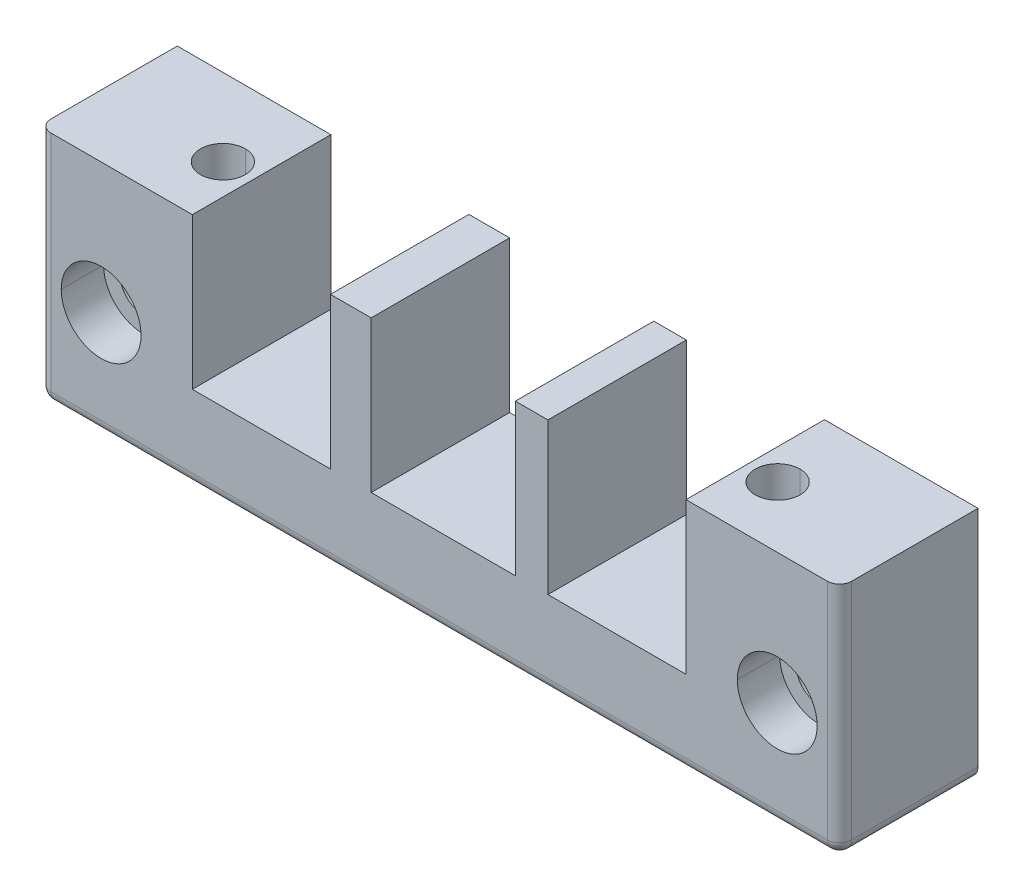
ISO-10303-21;
HEADER;
FILE_DESCRIPTION(('STEP AP214'),'2;1');
FILE_NAME('part.step','',(''),(''),'','','');
FILE_SCHEMA(('AUTOMOTIVE_DESIGN { 1 0 10303 214 1 1 1 1 }'));
ENDSEC;
DATA;
#1=APPLICATION_CONTEXT('core data for automotive mechanical design processes');
#2=APPLICATION_PROTOCOL_DEFINITION('international standard','automotive_design',2000,#1);
#3=PRODUCT_CONTEXT('',#1,'mechanical');
#4=PRODUCT('Part','Part','',(#3));
#5=PRODUCT_RELATED_PRODUCT_CATEGORY('part','',(#4));
#6=PRODUCT_DEFINITION_FORMATION('','',#4);
#7=PRODUCT_DEFINITION_CONTEXT('part definition',#1,'design');
#8=PRODUCT_DEFINITION('design','',#6,#7);
#9=PRODUCT_DEFINITION_SHAPE('','',#8);
#10=(LENGTH_UNIT() NAMED_UNIT(*) SI_UNIT(.MILLI.,.METRE.));
#11=(NAMED_UNIT(*) PLANE_ANGLE_UNIT() SI_UNIT($,.RADIAN.));
#12=(NAMED_UNIT(*) SI_UNIT($,.STERADIAN.) SOLID_ANGLE_UNIT());
#13=UNCERTAINTY_MEASURE_WITH_UNIT(LENGTH_MEASURE(1.E-05),#10,'distance_accuracy_value','');
#14=(GEOMETRIC_REPRESENTATION_CONTEXT(3) GLOBAL_UNCERTAINTY_ASSIGNED_CONTEXT((#13)) GLOBAL_UNIT_ASSIGNED_CONTEXT((#10,
#11,#12)) REPRESENTATION_CONTEXT('',''));
#15=CARTESIAN_POINT('',(0.,0.,0.));
#16=DIRECTION('',(0.,0.,1.));
#17=DIRECTION('',(1.,0.,0.));
#18=AXIS2_PLACEMENT_3D('',#15,#16,#17);
#19=CARTESIAN_POINT('',(31.5962613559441,-12.75,-3.25));
#20=DIRECTION('',(0.,0.,-1.));
#21=DIRECTION('',(0.,-1.,0.));
#22=AXIS2_PLACEMENT_3D('',#19,#20,#21);
#23=PLANE('',#22);
#24=DIRECTION('',(1.,0.,0.));
#25=VECTOR('',#24,1.);
#26=CARTESIAN_POINT('',(31.5962613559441,-19.75,-3.25));
#27=LINE('',#26,#25);
#28=CARTESIAN_POINT('',(31.5962613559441,-19.75,-3.25));
#29=VERTEX_POINT('',#28);
#30=CARTESIAN_POINT('',(36.5037386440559,-19.75,-3.25));
#31=VERTEX_POINT('',#30);
#32=EDGE_CURVE('E698',#29,#31,#27,.T.);
#33=ORIENTED_EDGE('',*,*,#32,.T.);
#34=DIRECTION('',(0.,-1.,0.));
#35=VECTOR('',#34,1.);
#36=CARTESIAN_POINT('',(36.5037386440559,-12.75,-3.25));
#37=LINE('',#36,#35);
#38=CARTESIAN_POINT('',(36.5037386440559,-12.75,-3.25));
#39=VERTEX_POINT('',#38);
#40=EDGE_CURVE('E10',#39,#31,#37,.T.);
#41=ORIENTED_EDGE('',*,*,#40,.F.);
#42=DIRECTION('',(1.,0.,0.));
#43=VECTOR('',#42,1.);
#44=CARTESIAN_POINT('',(31.5962613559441,-12.75,-3.25));
#45=LINE('',#44,#43);
#46=CARTESIAN_POINT('',(31.5962613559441,-12.75,-3.25));
#47=VERTEX_POINT('',#46);
#48=EDGE_CURVE('E480',#47,#39,#45,.T.);
#49=ORIENTED_EDGE('',*,*,#48,.F.);
#50=DIRECTION('',(0.,-1.,0.));
#51=VECTOR('',#50,1.);
#52=CARTESIAN_POINT('',(31.5962613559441,-12.75,-3.25));
#53=LINE('',#52,#51);
#54=EDGE_CURVE('E621',#47,#29,#53,.T.);
#55=ORIENTED_EDGE('',*,*,#54,.T.);
#56=EDGE_LOOP('',(#33,#41,#49,#55));
#57=FACE_BOUND('',#56,.T.);
#58=ADVANCED_FACE('F15',(#57),#23,.F.);
#59=CARTESIAN_POINT('',(36.5037386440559,-12.75,-3.25));
#60=DIRECTION('',(0.866025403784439,0.,-0.5));
#61=DIRECTION('',(0.,-1.,0.));
#62=AXIS2_PLACEMENT_3D('',#59,#60,#61);
#63=PLANE('',#62);
#64=DIRECTION('',(0.5,0.,0.866025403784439));
#65=VECTOR('',#64,1.);
#66=CARTESIAN_POINT('',(36.5037386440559,-19.75,-3.25));
#67=LINE('',#66,#65);
#68=CARTESIAN_POINT('',(38.9574772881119,-19.75,0.999999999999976));
#69=VERTEX_POINT('',#68);
#70=EDGE_CURVE('E640',#31,#69,#67,.T.);
#71=ORIENTED_EDGE('',*,*,#70,.T.);
#72=DIRECTION('',(0.,-1.,0.));
#73=VECTOR('',#72,1.);
#74=CARTESIAN_POINT('',(38.9574772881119,-12.75,0.999999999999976));
#75=LINE('',#74,#73);
#76=CARTESIAN_POINT('',(38.9574772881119,-12.75,0.999999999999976));
#77=VERTEX_POINT('',#76);
#78=EDGE_CURVE('E23',#77,#69,#75,.T.);
#79=ORIENTED_EDGE('',*,*,#78,.F.);
#80=DIRECTION('',(0.5,0.,0.866025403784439));
#81=VECTOR('',#80,1.);
#82=CARTESIAN_POINT('',(36.5037386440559,-12.75,-3.25));
#83=LINE('',#82,#81);
#84=EDGE_CURVE('E513',#39,#77,#83,.T.);
#85=ORIENTED_EDGE('',*,*,#84,.F.);
#86=ORIENTED_EDGE('',*,*,#40,.T.);
#87=EDGE_LOOP('',(#71,#79,#85,#86));
#88=FACE_BOUND('',#87,.T.);
#89=ADVANCED_FACE('F641',(#88),#63,.F.);
#90=CARTESIAN_POINT('',(38.9574772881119,-12.75,0.999999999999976));
#91=DIRECTION('',(0.866025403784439,0.,0.5));
#92=DIRECTION('',(0.,-1.,0.));
#93=AXIS2_PLACEMENT_3D('',#90,#91,#92);
#94=PLANE('',#93);
#95=DIRECTION('',(-0.5,0.,0.866025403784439));
#96=VECTOR('',#95,1.);
#97=CARTESIAN_POINT('',(38.9574772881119,-19.75,0.999999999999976));
#98=LINE('',#97,#96);
#99=CARTESIAN_POINT('',(36.5037386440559,-19.75,5.25));
#100=VERTEX_POINT('',#99);
#101=EDGE_CURVE('E635',#69,#100,#98,.T.);
#102=ORIENTED_EDGE('',*,*,#101,.T.);
#103=DIRECTION('',(0.,-1.,0.));
#104=VECTOR('',#103,1.);
#105=CARTESIAN_POINT('',(36.5037386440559,-12.75,5.25));
#106=LINE('',#105,#104);
#107=CARTESIAN_POINT('',(36.5037386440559,-12.75,5.25));
#108=VERTEX_POINT('',#107);
#109=EDGE_CURVE('E47',#108,#100,#106,.T.);
#110=ORIENTED_EDGE('',*,*,#109,.F.);
#111=DIRECTION('',(-0.5,0.,0.866025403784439));
#112=VECTOR('',#111,1.);
#113=CARTESIAN_POINT('',(38.9574772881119,-12.75,0.999999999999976));
#114=LINE('',#113,#112);
#115=EDGE_CURVE('E508',#77,#108,#114,.T.);
#116=ORIENTED_EDGE('',*,*,#115,.F.);
#117=ORIENTED_EDGE('',*,*,#78,.T.);
#118=EDGE_LOOP('',(#102,#110,#116,#117));
#119=FACE_BOUND('',#118,.T.);
#120=ADVANCED_FACE('F633',(#119),#94,.F.);
#121=CARTESIAN_POINT('',(36.5037386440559,-12.75,5.25));
#122=DIRECTION('',(0.,0.,1.));
#123=DIRECTION('',(1.,0.,0.));
#124=AXIS2_PLACEMENT_3D('',#121,#122,#123);
#125=PLANE('',#124);
#126=DIRECTION('',(-1.,0.,0.));
#127=VECTOR('',#126,1.);
#128=CARTESIAN_POINT('',(36.5037386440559,-19.75,5.25));
#129=LINE('',#128,#127);
#130=CARTESIAN_POINT('',(31.5962613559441,-19.75,5.25));
#131=VERTEX_POINT('',#130);
#132=EDGE_CURVE('E649',#100,#131,#129,.T.);
#133=ORIENTED_EDGE('',*,*,#132,.T.);
#134=DIRECTION('',(0.,-1.,0.));
#135=VECTOR('',#134,1.);
#136=CARTESIAN_POINT('',(31.5962613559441,-12.75,5.25));
#137=LINE('',#136,#135);
#138=CARTESIAN_POINT('',(31.5962613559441,-12.75,5.25));
#139=VERTEX_POINT('',#138);
#140=EDGE_CURVE('E34',#139,#131,#137,.T.);
#141=ORIENTED_EDGE('',*,*,#140,.F.);
#142=DIRECTION('',(-1.,0.,0.));
#143=VECTOR('',#142,1.);
#144=CARTESIAN_POINT('',(36.5037386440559,-12.75,5.25));
#145=LINE('',#144,#143);
#146=EDGE_CURVE('E512',#108,#139,#145,.T.);
#147=ORIENTED_EDGE('',*,*,#146,.F.);
#148=ORIENTED_EDGE('',*,*,#109,.T.);
#149=EDGE_LOOP('',(#133,#141,#147,#148));
#150=FACE_BOUND('',#149,.T.);
#151=ADVANCED_FACE('F844',(#150),#125,.F.);
#152=CARTESIAN_POINT('',(31.5962613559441,-12.75,5.25));
#153=DIRECTION('',(-0.866025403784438,0.,0.5));
#154=DIRECTION('',(0.,1.,0.));
#155=AXIS2_PLACEMENT_3D('',#152,#153,#154);
#156=PLANE('',#155);
#157=DIRECTION('',(-0.5,0.,-0.866025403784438));
#158=VECTOR('',#157,1.);
#159=CARTESIAN_POINT('',(31.5962613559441,-19.75,5.25));
#160=LINE('',#159,#158);
#161=CARTESIAN_POINT('',(29.1425227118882,-19.75,0.99999999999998));
#162=VERTEX_POINT('',#161);
#163=EDGE_CURVE('E656',#131,#162,#160,.T.);
#164=ORIENTED_EDGE('',*,*,#163,.T.);
#165=DIRECTION('',(0.,-1.,0.));
#166=VECTOR('',#165,1.);
#167=CARTESIAN_POINT('',(29.1425227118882,-12.75,0.99999999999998));
#168=LINE('',#167,#166);
#169=CARTESIAN_POINT('',(29.1425227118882,-12.75,0.99999999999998));
#170=VERTEX_POINT('',#169);
#171=EDGE_CURVE('E624',#170,#162,#168,.T.);
#172=ORIENTED_EDGE('',*,*,#171,.F.);
#173=DIRECTION('',(-0.5,0.,-0.866025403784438));
#174=VECTOR('',#173,1.);
#175=CARTESIAN_POINT('',(31.5962613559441,-12.75,5.25));
#176=LINE('',#175,#174);
#177=EDGE_CURVE('E524',#139,#170,#176,.T.);
#178=ORIENTED_EDGE('',*,*,#177,.F.);
#179=ORIENTED_EDGE('',*,*,#140,.T.);
#180=EDGE_LOOP('',(#164,#172,#178,#179));
#181=FACE_BOUND('',#180,.T.);
#182=ADVANCED_FACE('F838',(#181),#156,.F.);
#183=CARTESIAN_POINT('',(29.1425227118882,-12.75,0.99999999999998));
#184=DIRECTION('',(-0.866025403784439,0.,-0.5));
#185=DIRECTION('',(-0.5,0.,0.866025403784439));
#186=AXIS2_PLACEMENT_3D('',#183,#184,#185);
#187=PLANE('',#186);
#188=DIRECTION('',(0.5,0.,-0.866025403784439));
#189=VECTOR('',#188,1.);
#190=CARTESIAN_POINT('',(29.1425227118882,-19.75,0.99999999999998));
#191=LINE('',#190,#189);
#192=EDGE_CURVE('E703',#162,#29,#191,.T.);
#193=ORIENTED_EDGE('',*,*,#192,.T.);
#194=ORIENTED_EDGE('',*,*,#54,.F.);
#195=DIRECTION('',(0.5,0.,-0.866025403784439));
#196=VECTOR('',#195,1.);
#197=CARTESIAN_POINT('',(29.1425227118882,-12.75,0.99999999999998));
#198=LINE('',#197,#196);
#199=EDGE_CURVE('E476',#170,#47,#198,.T.);
#200=ORIENTED_EDGE('',*,*,#199,.F.);
#201=ORIENTED_EDGE('',*,*,#171,.T.);
#202=EDGE_LOOP('',(#193,#194,#200,#201));
#203=FACE_BOUND('',#202,.T.);
#204=ADVANCED_FACE('F840',(#203),#187,.F.);
#205=CARTESIAN_POINT('',(0.,-12.75,0.));
#206=DIRECTION('',(0.,-1.,0.));
#207=DIRECTION('',(0.,0.,-1.));
#208=AXIS2_PLACEMENT_3D('',#205,#206,#207);
#209=PLANE('',#208);
#210=CARTESIAN_POINT('',(34.05,-12.75,1.));
#211=DIRECTION('',(0.,1.,0.));
#212=DIRECTION('',(0.,0.,-1.));
#213=AXIS2_PLACEMENT_3D('',#210,#211,#212);
#214=CIRCLE('',#213,2.75);
#215=CARTESIAN_POINT('',(34.05,-12.75,3.75));
#216=VERTEX_POINT('',#215);
#217=CARTESIAN_POINT('',(34.05,-12.75,-1.75));
#218=VERTEX_POINT('',#217);
#219=EDGE_CURVE('E763',#216,#218,#214,.T.);
#220=ORIENTED_EDGE('',*,*,#219,.T.);
#221=CARTESIAN_POINT('',(34.05,-12.75,1.));
#222=DIRECTION('',(0.,1.,0.));
#223=DIRECTION('',(0.,0.,-1.));
#224=AXIS2_PLACEMENT_3D('',#221,#222,#223);
#225=CIRCLE('',#224,2.75);
#226=EDGE_CURVE('E741',#218,#216,#225,.T.);
#227=ORIENTED_EDGE('',*,*,#226,.T.);
#228=EDGE_LOOP('',(#220,#227));
#229=FACE_BOUND('',#228,.T.);
#230=ORIENTED_EDGE('',*,*,#199,.T.);
#231=ORIENTED_EDGE('',*,*,#48,.T.);
#232=ORIENTED_EDGE('',*,*,#84,.T.);
#233=ORIENTED_EDGE('',*,*,#115,.T.);
#234=ORIENTED_EDGE('',*,*,#146,.T.);
#235=ORIENTED_EDGE('',*,*,#177,.T.);
#236=EDGE_LOOP('',(#230,#231,#232,#233,#234,#235));
#237=FACE_BOUND('',#236,.T.);
#238=ADVANCED_FACE('F843',(#229,#237),#209,.T.);
#239=CARTESIAN_POINT('',(-31.5962613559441,-12.75,-3.25));
#240=DIRECTION('',(0.866025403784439,0.,-0.5));
#241=DIRECTION('',(0.,-1.,0.));
#242=AXIS2_PLACEMENT_3D('',#239,#240,#241);
#243=PLANE('',#242);
#244=DIRECTION('',(0.5,0.,0.866025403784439));
#245=VECTOR('',#244,1.);
#246=CARTESIAN_POINT('',(-31.5962613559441,-19.75,-3.25));
#247=LINE('',#246,#245);
#248=CARTESIAN_POINT('',(-31.5962613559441,-19.75,-3.25));
#249=VERTEX_POINT('',#248);
#250=CARTESIAN_POINT('',(-29.1425227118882,-19.75,1.));
#251=VERTEX_POINT('',#250);
#252=EDGE_CURVE('E645',#249,#251,#247,.T.);
#253=ORIENTED_EDGE('',*,*,#252,.T.);
#254=DIRECTION('',(0.,-1.,0.));
#255=VECTOR('',#254,1.);
#256=CARTESIAN_POINT('',(-29.1425227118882,-12.75,1.));
#257=LINE('',#256,#255);
#258=CARTESIAN_POINT('',(-29.1425227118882,-12.75,1.));
#259=VERTEX_POINT('',#258);
#260=EDGE_CURVE('E481',#259,#251,#257,.T.);
#261=ORIENTED_EDGE('',*,*,#260,.F.);
#262=DIRECTION('',(0.5,0.,0.866025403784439));
#263=VECTOR('',#262,1.);
#264=CARTESIAN_POINT('',(-31.5962613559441,-12.75,-3.25));
#265=LINE('',#264,#263);
#266=CARTESIAN_POINT('',(-31.5962613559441,-12.75,-3.25));
#267=VERTEX_POINT('',#266);
#268=EDGE_CURVE('E562',#267,#259,#265,.T.);
#269=ORIENTED_EDGE('',*,*,#268,.F.);
#270=DIRECTION('',(0.,-1.,0.));
#271=VECTOR('',#270,1.);
#272=CARTESIAN_POINT('',(-31.5962613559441,-12.75,-3.25));
#273=LINE('',#272,#271);
#274=EDGE_CURVE('E450',#267,#249,#273,.T.);
#275=ORIENTED_EDGE('',*,*,#274,.T.);
#276=EDGE_LOOP('',(#253,#261,#269,#275));
#277=FACE_BOUND('',#276,.T.);
#278=ADVANCED_FACE('F676',(#277),#243,.F.);
#279=CARTESIAN_POINT('',(-29.1425227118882,-12.75,1.));
#280=DIRECTION('',(0.866025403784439,0.,0.5));
#281=DIRECTION('',(0.,-1.,0.));
#282=AXIS2_PLACEMENT_3D('',#279,#280,#281);
#283=PLANE('',#282);
#284=DIRECTION('',(-0.5,0.,0.866025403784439));
#285=VECTOR('',#284,1.);
#286=CARTESIAN_POINT('',(-29.1425227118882,-19.75,1.));
#287=LINE('',#286,#285);
#288=CARTESIAN_POINT('',(-31.5962613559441,-19.75,5.25));
#289=VERTEX_POINT('',#288);
#290=EDGE_CURVE('E417',#251,#289,#287,.T.);
#291=ORIENTED_EDGE('',*,*,#290,.T.);
#292=DIRECTION('',(0.,-1.,0.));
#293=VECTOR('',#292,1.);
#294=CARTESIAN_POINT('',(-31.5962613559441,-12.75,5.25));
#295=LINE('',#294,#293);
#296=CARTESIAN_POINT('',(-31.5962613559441,-12.75,5.25));
#297=VERTEX_POINT('',#296);
#298=EDGE_CURVE('E408',#297,#289,#295,.T.);
#299=ORIENTED_EDGE('',*,*,#298,.F.);
#300=DIRECTION('',(-0.5,0.,0.866025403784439));
#301=VECTOR('',#300,1.);
#302=CARTESIAN_POINT('',(-29.1425227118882,-12.75,1.));
#303=LINE('',#302,#301);
#304=EDGE_CURVE('E575',#259,#297,#303,.T.);
#305=ORIENTED_EDGE('',*,*,#304,.F.);
#306=ORIENTED_EDGE('',*,*,#260,.T.);
#307=EDGE_LOOP('',(#291,#299,#305,#306));
#308=FACE_BOUND('',#307,.T.);
#309=ADVANCED_FACE('F860',(#308),#283,.F.);
#310=CARTESIAN_POINT('',(-31.5962613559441,-12.75,5.25));
#311=DIRECTION('',(0.,0.,1.));
#312=DIRECTION('',(1.,0.,0.));
#313=AXIS2_PLACEMENT_3D('',#310,#311,#312);
#314=PLANE('',#313);
#315=DIRECTION('',(-1.,0.,0.));
#316=VECTOR('',#315,1.);
#317=CARTESIAN_POINT('',(-31.5962613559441,-19.75,5.25));
#318=LINE('',#317,#316);
#319=CARTESIAN_POINT('',(-36.5037386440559,-19.75,5.25));
#320=VERTEX_POINT('',#319);
#321=EDGE_CURVE('E411',#289,#320,#318,.T.);
#322=ORIENTED_EDGE('',*,*,#321,.T.);
#323=DIRECTION('',(0.,-1.,0.));
#324=VECTOR('',#323,1.);
#325=CARTESIAN_POINT('',(-36.5037386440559,-12.75,5.25));
#326=LINE('',#325,#324);
#327=CARTESIAN_POINT('',(-36.5037386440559,-12.75,5.25));
#328=VERTEX_POINT('',#327);
#329=EDGE_CURVE('E157',#328,#320,#326,.T.);
#330=ORIENTED_EDGE('',*,*,#329,.F.);
#331=DIRECTION('',(-1.,0.,0.));
#332=VECTOR('',#331,1.);
#333=CARTESIAN_POINT('',(-31.5962613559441,-12.75,5.25));
#334=LINE('',#333,#332);
#335=EDGE_CURVE('E582',#297,#328,#334,.T.);
#336=ORIENTED_EDGE('',*,*,#335,.F.);
#337=ORIENTED_EDGE('',*,*,#298,.T.);
#338=EDGE_LOOP('',(#322,#330,#336,#337));
#339=FACE_BOUND('',#338,.T.);
#340=ADVANCED_FACE('F412',(#339),#314,.F.);
#341=CARTESIAN_POINT('',(-36.5037386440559,-12.75,5.25));
#342=DIRECTION('',(-0.866025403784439,0.,0.5));
#343=DIRECTION('',(0.,1.,0.));
#344=AXIS2_PLACEMENT_3D('',#341,#342,#343);
#345=PLANE('',#344);
#346=DIRECTION('',(-0.5,0.,-0.866025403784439));
#347=VECTOR('',#346,1.);
#348=CARTESIAN_POINT('',(-36.5037386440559,-19.75,5.25));
#349=LINE('',#348,#347);
#350=CARTESIAN_POINT('',(-38.9574772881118,-19.75,1.));
#351=VERTEX_POINT('',#350);
#352=EDGE_CURVE('E402',#320,#351,#349,.T.);
#353=ORIENTED_EDGE('',*,*,#352,.T.);
#354=DIRECTION('',(0.,-1.,0.));
#355=VECTOR('',#354,1.);
#356=CARTESIAN_POINT('',(-38.9574772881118,-12.75,1.));
#357=LINE('',#356,#355);
#358=CARTESIAN_POINT('',(-38.9574772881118,-12.75,1.));
#359=VERTEX_POINT('',#358);
#360=EDGE_CURVE('E168',#359,#351,#357,.T.);
#361=ORIENTED_EDGE('',*,*,#360,.F.);
#362=DIRECTION('',(-0.5,0.,-0.866025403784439));
#363=VECTOR('',#362,1.);
#364=CARTESIAN_POINT('',(-36.5037386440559,-12.75,5.25));
#365=LINE('',#364,#363);
#366=EDGE_CURVE('E405',#328,#359,#365,.T.);
#367=ORIENTED_EDGE('',*,*,#366,.F.);
#368=ORIENTED_EDGE('',*,*,#329,.T.);
#369=EDGE_LOOP('',(#353,#361,#367,#368));
#370=FACE_BOUND('',#369,.T.);
#371=ADVANCED_FACE('F400',(#370),#345,.F.);
#372=CARTESIAN_POINT('',(-38.9574772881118,-12.75,1.));
#373=DIRECTION('',(-0.866025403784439,0.,-0.5));
#374=DIRECTION('',(-0.5,0.,0.866025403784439));
#375=AXIS2_PLACEMENT_3D('',#372,#373,#374);
#376=PLANE('',#375);
#377=DIRECTION('',(0.5,0.,-0.866025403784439));
#378=VECTOR('',#377,1.);
#379=CARTESIAN_POINT('',(-38.9574772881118,-19.75,1.));
#380=LINE('',#379,#378);
#381=CARTESIAN_POINT('',(-36.5037386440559,-19.75,-3.25));
#382=VERTEX_POINT('',#381);
#383=EDGE_CURVE('E423',#351,#382,#380,.T.);
#384=ORIENTED_EDGE('',*,*,#383,.T.);
#385=DIRECTION('',(0.,-1.,0.));
#386=VECTOR('',#385,1.);
#387=CARTESIAN_POINT('',(-36.5037386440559,-12.75,-3.25));
#388=LINE('',#387,#386);
#389=CARTESIAN_POINT('',(-36.5037386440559,-12.75,-3.25));
#390=VERTEX_POINT('',#389);
#391=EDGE_CURVE('E453',#390,#382,#388,.T.);
#392=ORIENTED_EDGE('',*,*,#391,.F.);
#393=DIRECTION('',(0.5,0.,-0.866025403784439));
#394=VECTOR('',#393,1.);
#395=CARTESIAN_POINT('',(-38.9574772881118,-12.75,1.));
#396=LINE('',#395,#394);
#397=EDGE_CURVE('E454',#359,#390,#396,.T.);
#398=ORIENTED_EDGE('',*,*,#397,.F.);
#399=ORIENTED_EDGE('',*,*,#360,.T.);
#400=EDGE_LOOP('',(#384,#392,#398,#399));
#401=FACE_BOUND('',#400,.T.);
#402=ADVANCED_FACE('F681',(#401),#376,.F.);
#403=CARTESIAN_POINT('',(-36.5037386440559,-12.75,-3.25));
#404=DIRECTION('',(0.,0.,-1.));
#405=DIRECTION('',(0.,-1.,0.));
#406=AXIS2_PLACEMENT_3D('',#403,#404,#405);
#407=PLANE('',#406);
#408=DIRECTION('',(1.,0.,0.));
#409=VECTOR('',#408,1.);
#410=CARTESIAN_POINT('',(-36.5037386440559,-19.75,-3.25));
#411=LINE('',#410,#409);
#412=EDGE_CURVE('E429',#382,#249,#411,.T.);
#413=ORIENTED_EDGE('',*,*,#412,.T.);
#414=ORIENTED_EDGE('',*,*,#274,.F.);
#415=DIRECTION('',(1.,0.,0.));
#416=VECTOR('',#415,1.);
#417=CARTESIAN_POINT('',(-36.5037386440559,-12.75,-3.25));
#418=LINE('',#417,#416);
#419=EDGE_CURVE('E558',#390,#267,#418,.T.);
#420=ORIENTED_EDGE('',*,*,#419,.F.);
#421=ORIENTED_EDGE('',*,*,#391,.T.);
#422=EDGE_LOOP('',(#413,#414,#420,#421));
#423=FACE_BOUND('',#422,.T.);
#424=ADVANCED_FACE('F672',(#423),#407,.F.);
#425=CARTESIAN_POINT('',(0.,-12.75,0.));
#426=DIRECTION('',(0.,-1.,0.));
#427=DIRECTION('',(0.,0.,-1.));
#428=AXIS2_PLACEMENT_3D('',#425,#426,#427);
#429=PLANE('',#428);
#430=CARTESIAN_POINT('',(-34.05,-12.75,1.));
#431=DIRECTION('',(0.,1.,0.));
#432=DIRECTION('',(0.,0.,-1.));
#433=AXIS2_PLACEMENT_3D('',#430,#431,#432);
#434=CIRCLE('',#433,2.75);
#435=CARTESIAN_POINT('',(-34.05,-12.75,3.75));
#436=VERTEX_POINT('',#435);
#437=CARTESIAN_POINT('',(-34.05,-12.75,-1.75));
#438=VERTEX_POINT('',#437);
#439=EDGE_CURVE('E771',#436,#438,#434,.T.);
#440=ORIENTED_EDGE('',*,*,#439,.T.);
#441=CARTESIAN_POINT('',(-34.05,-12.75,1.));
#442=DIRECTION('',(0.,1.,0.));
#443=DIRECTION('',(0.,0.,-1.));
#444=AXIS2_PLACEMENT_3D('',#441,#442,#443);
#445=CIRCLE('',#444,2.75);
#446=EDGE_CURVE('E720',#438,#436,#445,.T.);
#447=ORIENTED_EDGE('',*,*,#446,.T.);
#448=EDGE_LOOP('',(#440,#447));
#449=FACE_BOUND('',#448,.T.);
#450=ORIENTED_EDGE('',*,*,#419,.T.);
#451=ORIENTED_EDGE('',*,*,#268,.T.);
#452=ORIENTED_EDGE('',*,*,#304,.T.);
#453=ORIENTED_EDGE('',*,*,#335,.T.);
#454=ORIENTED_EDGE('',*,*,#366,.T.);
#455=ORIENTED_EDGE('',*,*,#397,.T.);
#456=EDGE_LOOP('',(#450,#451,#452,#453,#454,#455));
#457=FACE_BOUND('',#456,.T.);
#458=ADVANCED_FACE('F680',(#449,#457),#429,.T.);
#459=CARTESIAN_POINT('',(-49.15,9.245,-8.5));
#460=DIRECTION('',(0.,-1.,0.));
#461=DIRECTION('',(0.,0.,-1.));
#462=AXIS2_PLACEMENT_3D('',#459,#460,#461);
#463=PLANE('',#462);
#464=DIRECTION('',(0.,0.,1.));
#465=VECTOR('',#464,1.);
#466=CARTESIAN_POINT('',(-13.35,9.245,-27.8086120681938));
#467=LINE('',#466,#465);
#468=CARTESIAN_POINT('',(-13.35,9.245,-8.5));
#469=VERTEX_POINT('',#468);
#470=CARTESIAN_POINT('',(-13.35,9.245,8.5));
#471=VERTEX_POINT('',#470);
#472=EDGE_CURVE('E590',#469,#471,#467,.T.);
#473=ORIENTED_EDGE('',*,*,#472,.T.);
#474=DIRECTION('',(1.,0.,0.));
#475=VECTOR('',#474,1.);
#476=CARTESIAN_POINT('',(-49.15,9.245,8.5));
#477=LINE('',#476,#475);
#478=CARTESIAN_POINT('',(-8.35,9.245,8.5));
#479=VERTEX_POINT('',#478);
#480=EDGE_CURVE('E438',#471,#479,#477,.T.);
#481=ORIENTED_EDGE('',*,*,#480,.T.);
#482=DIRECTION('',(0.,0.,-1.));
#483=VECTOR('',#482,1.);
#484=CARTESIAN_POINT('',(-8.35,9.245,-27.8086120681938));
#485=LINE('',#484,#483);
#486=CARTESIAN_POINT('',(-8.35,9.245,-8.5));
#487=VERTEX_POINT('',#486);
#488=EDGE_CURVE('E593',#479,#487,#485,.T.);
#489=ORIENTED_EDGE('',*,*,#488,.T.);
#490=DIRECTION('',(1.,0.,0.));
#491=VECTOR('',#490,1.);
#492=CARTESIAN_POINT('',(-49.15,9.245,-8.5));
#493=LINE('',#492,#491);
#494=EDGE_CURVE('E531',#469,#487,#493,.T.);
#495=ORIENTED_EDGE('',*,*,#494,.F.);
#496=EDGE_LOOP('',(#473,#481,#489,#495));
#497=FACE_BOUND('',#496,.T.);
#498=ADVANCED_FACE('F904',(#497),#463,.F.);
#499=CARTESIAN_POINT('',(-49.15,9.245,-8.5));
#500=DIRECTION('',(0.,-1.,0.));
#501=DIRECTION('',(0.,0.,-1.));
#502=AXIS2_PLACEMENT_3D('',#499,#500,#501);
#503=PLANE('',#502);
#504=DIRECTION('',(0.,0.,1.));
#505=VECTOR('',#504,1.);
#506=CARTESIAN_POINT('',(9.35,9.245,-27.8086120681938));
#507=LINE('',#506,#505);
#508=CARTESIAN_POINT('',(9.35,9.245,-8.5));
#509=VERTEX_POINT('',#508);
#510=CARTESIAN_POINT('',(9.35,9.245,8.5));
#511=VERTEX_POINT('',#510);
#512=EDGE_CURVE('E733',#509,#511,#507,.T.);
#513=ORIENTED_EDGE('',*,*,#512,.T.);
#514=DIRECTION('',(1.,0.,0.));
#515=VECTOR('',#514,1.);
#516=CARTESIAN_POINT('',(-49.15,9.245,8.5));
#517=LINE('',#516,#515);
#518=CARTESIAN_POINT('',(13.35,9.245,8.5));
#519=VERTEX_POINT('',#518);
#520=EDGE_CURVE('E485',#511,#519,#517,.T.);
#521=ORIENTED_EDGE('',*,*,#520,.T.);
#522=DIRECTION('',(0.,0.,-1.));
#523=VECTOR('',#522,1.);
#524=CARTESIAN_POINT('',(13.35,9.245,-27.8086120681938));
#525=LINE('',#524,#523);
#526=CARTESIAN_POINT('',(13.35,9.245,-8.5));
#527=VERTEX_POINT('',#526);
#528=EDGE_CURVE('E599',#519,#527,#525,.T.);
#529=ORIENTED_EDGE('',*,*,#528,.T.);
#530=DIRECTION('',(1.,0.,0.));
#531=VECTOR('',#530,1.);
#532=CARTESIAN_POINT('',(-49.15,9.245,-8.5));
#533=LINE('',#532,#531);
#534=EDGE_CURVE('E547',#509,#527,#533,.T.);
#535=ORIENTED_EDGE('',*,*,#534,.F.);
#536=EDGE_LOOP('',(#513,#521,#529,#535));
#537=FACE_BOUND('',#536,.T.);
#538=ADVANCED_FACE('F900',(#537),#503,.F.);
#539=CARTESIAN_POINT('',(-49.15,9.245,-8.5));
#540=DIRECTION('',(0.,-1.,0.));
#541=DIRECTION('',(0.,0.,-1.));
#542=AXIS2_PLACEMENT_3D('',#539,#540,#541);
#543=PLANE('',#542);
#544=CARTESIAN_POINT('',(34.05,9.245,1.));
#545=DIRECTION('',(0.,1.,0.));
#546=DIRECTION('',(1.,0.,0.));
#547=AXIS2_PLACEMENT_3D('',#544,#545,#546);
#548=CIRCLE('',#547,2.75);
#549=CARTESIAN_POINT('',(34.05,9.245,3.75));
#550=VERTEX_POINT('',#549);
#551=CARTESIAN_POINT('',(34.05,9.245,-1.75));
#552=VERTEX_POINT('',#551);
#553=EDGE_CURVE('E766',#550,#552,#548,.T.);
#554=ORIENTED_EDGE('',*,*,#553,.F.);
#555=CARTESIAN_POINT('',(34.05,9.245,1.));
#556=DIRECTION('',(0.,1.,0.));
#557=DIRECTION('',(1.,0.,0.));
#558=AXIS2_PLACEMENT_3D('',#555,#556,#557);
#559=CIRCLE('',#558,2.75);
#560=EDGE_CURVE('E752',#552,#550,#559,.T.);
#561=ORIENTED_EDGE('',*,*,#560,.F.);
#562=EDGE_LOOP('',(#554,#561));
#563=FACE_BOUND('',#562,.T.);
#564=DIRECTION('',(1.,0.,0.));
#565=VECTOR('',#564,1.);
#566=CARTESIAN_POINT('',(-49.15,9.245,8.5));
#567=LINE('',#566,#565);
#568=CARTESIAN_POINT('',(30.3,9.245,8.5));
#569=VERTEX_POINT('',#568);
#570=CARTESIAN_POINT('',(47.65,9.245,8.5));
#571=VERTEX_POINT('',#570);
#572=EDGE_CURVE('E468',#569,#571,#567,.T.);
#573=ORIENTED_EDGE('',*,*,#572,.T.);
#574=CARTESIAN_POINT('',(47.65,9.245,7.));
#575=DIRECTION('',(0.,1.,0.));
#576=DIRECTION('',(1.,0.,0.));
#577=AXIS2_PLACEMENT_3D('',#574,#575,#576);
#578=CIRCLE('',#577,1.5);
#579=CARTESIAN_POINT('',(49.15,9.245,7.));
#580=VERTEX_POINT('',#579);
#581=EDGE_CURVE('E506',#571,#580,#578,.T.);
#582=ORIENTED_EDGE('',*,*,#581,.T.);
#583=DIRECTION('',(0.,0.,1.));
#584=VECTOR('',#583,1.);
#585=CARTESIAN_POINT('',(49.15,9.245,-8.5));
#586=LINE('',#585,#584);
#587=CARTESIAN_POINT('',(49.15,9.245,-8.5));
#588=VERTEX_POINT('',#587);
#589=EDGE_CURVE('E455',#588,#580,#586,.T.);
#590=ORIENTED_EDGE('',*,*,#589,.F.);
#591=DIRECTION('',(1.,0.,0.));
#592=VECTOR('',#591,1.);
#593=CARTESIAN_POINT('',(-49.15,9.245,-8.5));
#594=LINE('',#593,#592);
#595=CARTESIAN_POINT('',(30.3,9.245,-8.5));
#596=VERTEX_POINT('',#595);
#597=EDGE_CURVE('E557',#596,#588,#594,.T.);
#598=ORIENTED_EDGE('',*,*,#597,.F.);
#599=DIRECTION('',(0.,0.,-1.));
#600=VECTOR('',#599,1.);
#601=CARTESIAN_POINT('',(30.3,9.245,-8.5));
#602=LINE('',#601,#600);
#603=EDGE_CURVE('E578',#569,#596,#602,.T.);
#604=ORIENTED_EDGE('',*,*,#603,.F.);
#605=EDGE_LOOP('',(#573,#582,#590,#598,#604));
#606=FACE_BOUND('',#605,.T.);
#607=ADVANCED_FACE('F896',(#563,#606),#543,.F.);
#608=CARTESIAN_POINT('',(-49.15,9.245,-8.5));
#609=DIRECTION('',(0.,-1.,0.));
#610=DIRECTION('',(0.,0.,-1.));
#611=AXIS2_PLACEMENT_3D('',#608,#609,#610);
#612=PLANE('',#611);
#613=CARTESIAN_POINT('',(-34.05,9.245,1.));
#614=DIRECTION('',(0.,1.,0.));
#615=DIRECTION('',(1.,0.,0.));
#616=AXIS2_PLACEMENT_3D('',#613,#614,#615);
#617=CIRCLE('',#616,2.75);
#618=CARTESIAN_POINT('',(-34.05,9.245,3.75));
#619=VERTEX_POINT('',#618);
#620=CARTESIAN_POINT('',(-34.05,9.245,-1.75));
#621=VERTEX_POINT('',#620);
#622=EDGE_CURVE('E776',#619,#621,#617,.T.);
#623=ORIENTED_EDGE('',*,*,#622,.F.);
#624=CARTESIAN_POINT('',(-34.05,9.245,1.));
#625=DIRECTION('',(0.,1.,0.));
#626=DIRECTION('',(1.,0.,0.));
#627=AXIS2_PLACEMENT_3D('',#624,#625,#626);
#628=CIRCLE('',#627,2.75);
#629=EDGE_CURVE('E730',#621,#619,#628,.T.);
#630=ORIENTED_EDGE('',*,*,#629,.F.);
#631=EDGE_LOOP('',(#623,#630));
#632=FACE_BOUND('',#631,.T.);
#633=DIRECTION('',(1.,0.,0.));
#634=VECTOR('',#633,1.);
#635=CARTESIAN_POINT('',(-49.15,9.245,-8.5));
#636=LINE('',#635,#634);
#637=CARTESIAN_POINT('',(-49.15,9.245,-8.5));
#638=VERTEX_POINT('',#637);
#639=CARTESIAN_POINT('',(-30.3,9.245,-8.5));
#640=VERTEX_POINT('',#639);
#641=EDGE_CURVE('E500',#638,#640,#636,.T.);
#642=ORIENTED_EDGE('',*,*,#641,.F.);
#643=DIRECTION('',(0.,0.,1.));
#644=VECTOR('',#643,1.);
#645=CARTESIAN_POINT('',(-49.15,9.245,-8.5));
#646=LINE('',#645,#644);
#647=CARTESIAN_POINT('',(-49.15,9.245,7.));
#648=VERTEX_POINT('',#647);
#649=EDGE_CURVE('E816',#638,#648,#646,.T.);
#650=ORIENTED_EDGE('',*,*,#649,.T.);
#651=CARTESIAN_POINT('',(-47.65,9.245,7.));
#652=DIRECTION('',(0.,1.,0.));
#653=DIRECTION('',(1.,0.,0.));
#654=AXIS2_PLACEMENT_3D('',#651,#652,#653);
#655=CIRCLE('',#654,1.5);
#656=CARTESIAN_POINT('',(-47.65,9.245,8.5));
#657=VERTEX_POINT('',#656);
#658=EDGE_CURVE('E507',#648,#657,#655,.T.);
#659=ORIENTED_EDGE('',*,*,#658,.T.);
#660=DIRECTION('',(1.,0.,0.));
#661=VECTOR('',#660,1.);
#662=CARTESIAN_POINT('',(-49.15,9.245,8.5));
#663=LINE('',#662,#661);
#664=CARTESIAN_POINT('',(-30.3,9.245,8.5));
#665=VERTEX_POINT('',#664);
#666=EDGE_CURVE('E789',#657,#665,#663,.T.);
#667=ORIENTED_EDGE('',*,*,#666,.T.);
#668=DIRECTION('',(0.,0.,1.));
#669=VECTOR('',#668,1.);
#670=CARTESIAN_POINT('',(-30.3,9.245,-8.5));
#671=LINE('',#670,#669);
#672=EDGE_CURVE('E570',#640,#665,#671,.T.);
#673=ORIENTED_EDGE('',*,*,#672,.F.);
#674=EDGE_LOOP('',(#642,#650,#659,#667,#673));
#675=FACE_BOUND('',#674,.T.);
#676=ADVANCED_FACE('F892',(#632,#675),#612,.F.);
#677=CARTESIAN_POINT('',(-41.5,-6.75,8.5));
#678=DIRECTION('',(0.,0.,1.));
#679=DIRECTION('',(1.,0.,0.));
#680=AXIS2_PLACEMENT_3D('',#677,#678,#679);
#681=CYLINDRICAL_SURFACE('',#680,4.9);
#682=DIRECTION('',(0.,0.,1.));
#683=VECTOR('',#682,1.);
#684=CARTESIAN_POINT('',(-46.4,-6.75,8.5));
#685=LINE('',#684,#683);
#686=CARTESIAN_POINT('',(-46.4,-6.75,3.3));
#687=VERTEX_POINT('',#686);
#688=CARTESIAN_POINT('',(-46.4,-6.75,8.5));
#689=VERTEX_POINT('',#688);
#690=EDGE_CURVE('E1026',#687,#689,#685,.T.);
#691=ORIENTED_EDGE('',*,*,#690,.F.);
#692=CARTESIAN_POINT('',(-41.5,-6.75,3.3));
#693=DIRECTION('',(0.,0.,1.));
#694=DIRECTION('',(1.,0.,0.));
#695=AXIS2_PLACEMENT_3D('',#692,#693,#694);
#696=CIRCLE('',#695,4.9);
#697=CARTESIAN_POINT('',(-36.6,-6.75,3.3));
#698=VERTEX_POINT('',#697);
#699=EDGE_CURVE('E542',#698,#687,#696,.T.);
#700=ORIENTED_EDGE('',*,*,#699,.F.);
#701=DIRECTION('',(0.,0.,1.));
#702=VECTOR('',#701,1.);
#703=CARTESIAN_POINT('',(-36.6,-6.75,8.5));
#704=LINE('',#703,#702);
#705=CARTESIAN_POINT('',(-36.6,-6.75,8.5));
#706=VERTEX_POINT('',#705);
#707=EDGE_CURVE('E1013',#698,#706,#704,.T.);
#708=ORIENTED_EDGE('',*,*,#707,.T.);
#709=CARTESIAN_POINT('',(-41.5,-6.75,8.5));
#710=DIRECTION('',(0.,0.,1.));
#711=DIRECTION('',(1.,0.,0.));
#712=AXIS2_PLACEMENT_3D('',#709,#710,#711);
#713=CIRCLE('',#712,4.9);
#714=EDGE_CURVE('E494',#706,#689,#713,.T.);
#715=ORIENTED_EDGE('',*,*,#714,.T.);
#716=EDGE_LOOP('',(#691,#700,#708,#715));
#717=FACE_BOUND('',#716,.T.);
#718=ADVANCED_FACE('F888',(#717),#681,.F.);
#719=CARTESIAN_POINT('',(-38.6,-6.75,3.3));
#720=DIRECTION('',(0.,0.,-1.));
#721=DIRECTION('',(0.,-1.,0.));
#722=AXIS2_PLACEMENT_3D('',#719,#720,#721);
#723=PLANE('',#722);
#724=CARTESIAN_POINT('',(-41.5,-6.75,3.3));
#725=DIRECTION('',(0.,0.,1.));
#726=DIRECTION('',(1.,0.,0.));
#727=AXIS2_PLACEMENT_3D('',#724,#725,#726);
#728=CIRCLE('',#727,2.9);
#729=CARTESIAN_POINT('',(-38.6,-6.75,3.3));
#730=VERTEX_POINT('',#729);
#731=CARTESIAN_POINT('',(-44.4,-6.75,3.3));
#732=VERTEX_POINT('',#731);
#733=EDGE_CURVE('E539',#730,#732,#728,.T.);
#734=ORIENTED_EDGE('',*,*,#733,.F.);
#735=CARTESIAN_POINT('',(-41.5,-6.75,3.3));
#736=DIRECTION('',(0.,0.,1.));
#737=DIRECTION('',(1.,0.,0.));
#738=AXIS2_PLACEMENT_3D('',#735,#736,#737);
#739=CIRCLE('',#738,2.9);
#740=EDGE_CURVE('E946',#732,#730,#739,.T.);
#741=ORIENTED_EDGE('',*,*,#740,.F.);
#742=EDGE_LOOP('',(#734,#741));
#743=FACE_BOUND('',#742,.T.);
#744=ORIENTED_EDGE('',*,*,#699,.T.);
#745=CARTESIAN_POINT('',(-41.5,-6.75,3.3));
#746=DIRECTION('',(0.,0.,1.));
#747=DIRECTION('',(1.,0.,0.));
#748=AXIS2_PLACEMENT_3D('',#745,#746,#747);
#749=CIRCLE('',#748,4.9);
#750=EDGE_CURVE('E1098',#687,#698,#749,.T.);
#751=ORIENTED_EDGE('',*,*,#750,.T.);
#752=EDGE_LOOP('',(#744,#751));
#753=FACE_BOUND('',#752,.T.);
#754=ADVANCED_FACE('F884',(#743,#753),#723,.F.);
#755=CARTESIAN_POINT('',(-41.5,-6.75,8.5));
#756=DIRECTION('',(0.,0.,1.));
#757=DIRECTION('',(1.,0.,0.));
#758=AXIS2_PLACEMENT_3D('',#755,#756,#757);
#759=CYLINDRICAL_SURFACE('',#758,2.9);
#760=DIRECTION('',(0.,0.,1.));
#761=VECTOR('',#760,1.);
#762=CARTESIAN_POINT('',(-44.4,-6.75,8.5));
#763=LINE('',#762,#761);
#764=CARTESIAN_POINT('',(-44.4,-6.75,-8.5));
#765=VERTEX_POINT('',#764);
#766=EDGE_CURVE('E1005',#765,#732,#763,.T.);
#767=ORIENTED_EDGE('',*,*,#766,.F.);
#768=CARTESIAN_POINT('',(-41.5,-6.75,-8.5));
#769=DIRECTION('',(0.,0.,1.));
#770=DIRECTION('',(1.,0.,0.));
#771=AXIS2_PLACEMENT_3D('',#768,#769,#770);
#772=CIRCLE('',#771,2.9);
#773=CARTESIAN_POINT('',(-38.6,-6.75,-8.5));
#774=VERTEX_POINT('',#773);
#775=EDGE_CURVE('E571',#774,#765,#772,.T.);
#776=ORIENTED_EDGE('',*,*,#775,.F.);
#777=DIRECTION('',(0.,0.,1.));
#778=VECTOR('',#777,1.);
#779=CARTESIAN_POINT('',(-38.6,-6.75,8.5));
#780=LINE('',#779,#778);
#781=EDGE_CURVE('E953',#774,#730,#780,.T.);
#782=ORIENTED_EDGE('',*,*,#781,.T.);
#783=ORIENTED_EDGE('',*,*,#733,.T.);
#784=EDGE_LOOP('',(#767,#776,#782,#783));
#785=FACE_BOUND('',#784,.T.);
#786=ADVANCED_FACE('F880',(#785),#759,.F.);
#787=CARTESIAN_POINT('',(41.5,-6.75,8.5));
#788=DIRECTION('',(0.,0.,1.));
#789=DIRECTION('',(1.,0.,0.));
#790=AXIS2_PLACEMENT_3D('',#787,#788,#789);
#791=CYLINDRICAL_SURFACE('',#790,4.9);
#792=DIRECTION('',(0.,0.,1.));
#793=VECTOR('',#792,1.);
#794=CARTESIAN_POINT('',(36.6,-6.75,8.5));
#795=LINE('',#794,#793);
#796=CARTESIAN_POINT('',(36.6,-6.75,3.3));
#797=VERTEX_POINT('',#796);
#798=CARTESIAN_POINT('',(36.6,-6.75,8.5));
#799=VERTEX_POINT('',#798);
#800=EDGE_CURVE('E966',#797,#799,#795,.T.);
#801=ORIENTED_EDGE('',*,*,#800,.F.);
#802=CARTESIAN_POINT('',(41.5,-6.75,3.3));
#803=DIRECTION('',(0.,0.,1.));
#804=DIRECTION('',(1.,0.,0.));
#805=AXIS2_PLACEMENT_3D('',#802,#803,#804);
#806=CIRCLE('',#805,4.9);
#807=CARTESIAN_POINT('',(46.4,-6.75,3.3));
#808=VERTEX_POINT('',#807);
#809=EDGE_CURVE('E543',#808,#797,#806,.T.);
#810=ORIENTED_EDGE('',*,*,#809,.F.);
#811=DIRECTION('',(0.,0.,1.));
#812=VECTOR('',#811,1.);
#813=CARTESIAN_POINT('',(46.4,-6.75,8.5));
#814=LINE('',#813,#812);
#815=CARTESIAN_POINT('',(46.4,-6.75,8.5));
#816=VERTEX_POINT('',#815);
#817=EDGE_CURVE('E969',#808,#816,#814,.T.);
#818=ORIENTED_EDGE('',*,*,#817,.T.);
#819=CARTESIAN_POINT('',(41.5,-6.75,8.5));
#820=DIRECTION('',(0.,0.,1.));
#821=DIRECTION('',(1.,0.,0.));
#822=AXIS2_PLACEMENT_3D('',#819,#820,#821);
#823=CIRCLE('',#822,4.9);
#824=EDGE_CURVE('E497',#816,#799,#823,.T.);
#825=ORIENTED_EDGE('',*,*,#824,.T.);
#826=EDGE_LOOP('',(#801,#810,#818,#825));
#827=FACE_BOUND('',#826,.T.);
#828=ADVANCED_FACE('F876',(#827),#791,.F.);
#829=CARTESIAN_POINT('',(44.4,-6.75,3.3));
#830=DIRECTION('',(0.,0.,-1.));
#831=DIRECTION('',(0.,-1.,0.));
#832=AXIS2_PLACEMENT_3D('',#829,#830,#831);
#833=PLANE('',#832);
#834=CARTESIAN_POINT('',(41.5,-6.75,3.3));
#835=DIRECTION('',(0.,0.,1.));
#836=DIRECTION('',(1.,0.,0.));
#837=AXIS2_PLACEMENT_3D('',#834,#835,#836);
#838=CIRCLE('',#837,2.9);
#839=CARTESIAN_POINT('',(44.4,-6.75,3.3));
#840=VERTEX_POINT('',#839);
#841=CARTESIAN_POINT('',(38.6,-6.75,3.3));
#842=VERTEX_POINT('',#841);
#843=EDGE_CURVE('E516',#840,#842,#838,.T.);
#844=ORIENTED_EDGE('',*,*,#843,.F.);
#845=CARTESIAN_POINT('',(41.5,-6.75,3.3));
#846=DIRECTION('',(0.,0.,1.));
#847=DIRECTION('',(1.,0.,0.));
#848=AXIS2_PLACEMENT_3D('',#845,#846,#847);
#849=CIRCLE('',#848,2.9);
#850=EDGE_CURVE('E721',#842,#840,#849,.T.);
#851=ORIENTED_EDGE('',*,*,#850,.F.);
#852=EDGE_LOOP('',(#844,#851));
#853=FACE_BOUND('',#852,.T.);
#854=ORIENTED_EDGE('',*,*,#809,.T.);
#855=CARTESIAN_POINT('',(41.5,-6.75,3.3));
#856=DIRECTION('',(0.,0.,1.));
#857=DIRECTION('',(1.,0.,0.));
#858=AXIS2_PLACEMENT_3D('',#855,#856,#857);
#859=CIRCLE('',#858,4.9);
#860=EDGE_CURVE('E957',#797,#808,#859,.T.);
#861=ORIENTED_EDGE('',*,*,#860,.T.);
#862=EDGE_LOOP('',(#854,#861));
#863=FACE_BOUND('',#862,.T.);
#864=ADVANCED_FACE('F873',(#853,#863),#833,.F.);
#865=CARTESIAN_POINT('',(41.5,-6.75,8.5));
#866=DIRECTION('',(0.,0.,1.));
#867=DIRECTION('',(1.,0.,0.));
#868=AXIS2_PLACEMENT_3D('',#865,#866,#867);
#869=CYLINDRICAL_SURFACE('',#868,2.9);
#870=DIRECTION('',(0.,0.,1.));
#871=VECTOR('',#870,1.);
#872=CARTESIAN_POINT('',(38.6,-6.75,8.5));
#873=LINE('',#872,#871);
#874=CARTESIAN_POINT('',(38.6,-6.75,-8.5));
#875=VERTEX_POINT('',#874);
#876=EDGE_CURVE('E952',#875,#842,#873,.T.);
#877=ORIENTED_EDGE('',*,*,#876,.F.);
#878=CARTESIAN_POINT('',(41.5,-6.75,-8.5));
#879=DIRECTION('',(0.,0.,1.));
#880=DIRECTION('',(1.,0.,0.));
#881=AXIS2_PLACEMENT_3D('',#878,#879,#880);
#882=CIRCLE('',#881,2.9);
#883=CARTESIAN_POINT('',(44.4,-6.75,-8.5));
#884=VERTEX_POINT('',#883);
#885=EDGE_CURVE('E567',#884,#875,#882,.T.);
#886=ORIENTED_EDGE('',*,*,#885,.F.);
#887=DIRECTION('',(0.,0.,1.));
#888=VECTOR('',#887,1.);
#889=CARTESIAN_POINT('',(44.4,-6.75,8.5));
#890=LINE('',#889,#888);
#891=EDGE_CURVE('E718',#884,#840,#890,.T.);
#892=ORIENTED_EDGE('',*,*,#891,.T.);
#893=ORIENTED_EDGE('',*,*,#843,.T.);
#894=EDGE_LOOP('',(#877,#886,#892,#893));
#895=FACE_BOUND('',#894,.T.);
#896=ADVANCED_FACE('F871',(#895),#869,.F.);
#897=CARTESIAN_POINT('',(47.65,0.,7.));
#898=DIRECTION('',(0.,-1.,0.));
#899=DIRECTION('',(0.,0.,-1.));
#900=AXIS2_PLACEMENT_3D('',#897,#898,#899);
#901=CYLINDRICAL_SURFACE('',#900,1.5);
#902=ORIENTED_EDGE('',*,*,#581,.F.);
#903=DIRECTION('',(0.,1.,0.));
#904=VECTOR('',#903,1.);
#905=CARTESIAN_POINT('',(47.65,19.75,8.5));
#906=LINE('',#905,#904);
#907=CARTESIAN_POINT('',(47.65,-18.25,8.5));
#908=VERTEX_POINT('',#907);
#909=EDGE_CURVE('E464',#908,#571,#906,.T.);
#910=ORIENTED_EDGE('',*,*,#909,.F.);
#911=CARTESIAN_POINT('',(47.65,-18.25,7.));
#912=DIRECTION('',(0.,1.,0.));
#913=DIRECTION('',(0.,0.,-1.));
#914=AXIS2_PLACEMENT_3D('',#911,#912,#913);
#915=CIRCLE('',#914,1.5);
#916=CARTESIAN_POINT('',(49.15,-18.25,7.));
#917=VERTEX_POINT('',#916);
#918=EDGE_CURVE('E503',#908,#917,#915,.T.);
#919=ORIENTED_EDGE('',*,*,#918,.T.);
#920=DIRECTION('',(0.,-1.,0.));
#921=VECTOR('',#920,1.);
#922=CARTESIAN_POINT('',(49.15,-19.75,7.));
#923=LINE('',#922,#921);
#924=EDGE_CURVE('E459',#580,#917,#923,.T.);
#925=ORIENTED_EDGE('',*,*,#924,.F.);
#926=EDGE_LOOP('',(#902,#910,#919,#925));
#927=FACE_BOUND('',#926,.T.);
#928=ADVANCED_FACE('F1047',(#927),#901,.T.);
#929=CARTESIAN_POINT('',(47.65,-18.25,7.));
#930=DIRECTION('',(0.,1.,0.));
#931=DIRECTION('',(1.,0.,0.));
#932=AXIS2_PLACEMENT_3D('',#929,#930,#931);
#933=SPHERICAL_SURFACE('',#932,1.5);
#934=CARTESIAN_POINT('',(47.65,-18.25,7.));
#935=DIRECTION('',(1.,0.,0.));
#936=DIRECTION('',(0.,0.,-1.));
#937=AXIS2_PLACEMENT_3D('',#934,#935,#936);
#938=CIRCLE('',#937,1.5);
#939=CARTESIAN_POINT('',(47.65,-19.75,7.));
#940=VERTEX_POINT('',#939);
#941=EDGE_CURVE('E436',#908,#940,#938,.T.);
#942=ORIENTED_EDGE('',*,*,#941,.T.);
#943=CARTESIAN_POINT('',(47.65,-18.25,7.));
#944=DIRECTION('',(0.,0.,1.));
#945=DIRECTION('',(1.,0.,0.));
#946=AXIS2_PLACEMENT_3D('',#943,#944,#945);
#947=CIRCLE('',#946,1.5);
#948=EDGE_CURVE('E433',#940,#917,#947,.T.);
#949=ORIENTED_EDGE('',*,*,#948,.T.);
#950=ORIENTED_EDGE('',*,*,#918,.F.);
#951=EDGE_LOOP('',(#942,#949,#950));
#952=FACE_BOUND('',#951,.T.);
#953=ADVANCED_FACE('F1050',(#952),#933,.T.);
#954=CARTESIAN_POINT('',(-47.65,0.,7.));
#955=DIRECTION('',(0.,1.,0.));
#956=DIRECTION('',(0.,0.,1.));
#957=AXIS2_PLACEMENT_3D('',#954,#955,#956);
#958=CYLINDRICAL_SURFACE('',#957,1.5);
#959=ORIENTED_EDGE('',*,*,#658,.F.);
#960=DIRECTION('',(0.,1.,0.));
#961=VECTOR('',#960,1.);
#962=CARTESIAN_POINT('',(-49.15,19.75,7.));
#963=LINE('',#962,#961);
#964=CARTESIAN_POINT('',(-49.15,-18.25,7.));
#965=VERTEX_POINT('',#964);
#966=EDGE_CURVE('E812',#965,#648,#963,.T.);
#967=ORIENTED_EDGE('',*,*,#966,.F.);
#968=CARTESIAN_POINT('',(-47.65,-18.25,7.));
#969=DIRECTION('',(0.,1.,0.));
#970=DIRECTION('',(0.,0.,-1.));
#971=AXIS2_PLACEMENT_3D('',#968,#969,#970);
#972=CIRCLE('',#971,1.5);
#973=CARTESIAN_POINT('',(-47.65,-18.25,8.5));
#974=VERTEX_POINT('',#973);
#975=EDGE_CURVE('E598',#965,#974,#972,.T.);
#976=ORIENTED_EDGE('',*,*,#975,.T.);
#977=DIRECTION('',(0.,-1.,0.));
#978=VECTOR('',#977,1.);
#979=CARTESIAN_POINT('',(-47.65,-19.75,8.5));
#980=LINE('',#979,#978);
#981=EDGE_CURVE('E660',#657,#974,#980,.T.);
#982=ORIENTED_EDGE('',*,*,#981,.F.);
#983=EDGE_LOOP('',(#959,#967,#976,#982));
#984=FACE_BOUND('',#983,.T.);
#985=ADVANCED_FACE('F936',(#984),#958,.T.);
#986=CARTESIAN_POINT('',(0.,-18.25,7.));
#987=DIRECTION('',(-1.,0.,0.));
#988=DIRECTION('',(0.,-1.,0.));
#989=AXIS2_PLACEMENT_3D('',#986,#987,#988);
#990=CYLINDRICAL_SURFACE('',#989,1.5);
#991=CARTESIAN_POINT('',(-47.65,-18.25,7.));
#992=DIRECTION('',(1.,0.,0.));
#993=DIRECTION('',(0.,0.,1.));
#994=AXIS2_PLACEMENT_3D('',#991,#992,#993);
#995=CIRCLE('',#994,1.5);
#996=CARTESIAN_POINT('',(-47.65,-19.75,7.));
#997=VERTEX_POINT('',#996);
#998=EDGE_CURVE('E437',#974,#997,#995,.T.);
#999=ORIENTED_EDGE('',*,*,#998,.T.);
#1000=DIRECTION('',(-1.,0.,0.));
#1001=VECTOR('',#1000,1.);
#1002=CARTESIAN_POINT('',(-49.15,-19.75,7.));
#1003=LINE('',#1002,#1001);
#1004=EDGE_CURVE('E713',#940,#997,#1003,.T.);
#1005=ORIENTED_EDGE('',*,*,#1004,.F.);
#1006=ORIENTED_EDGE('',*,*,#941,.F.);
#1007=DIRECTION('',(1.,0.,0.));
#1008=VECTOR('',#1007,1.);
#1009=CARTESIAN_POINT('',(49.15,-18.25,8.5));
#1010=LINE('',#1009,#1008);
#1011=EDGE_CURVE('E469',#974,#908,#1010,.T.);
#1012=ORIENTED_EDGE('',*,*,#1011,.F.);
#1013=EDGE_LOOP('',(#999,#1005,#1006,#1012));
#1014=FACE_BOUND('',#1013,.T.);
#1015=ADVANCED_FACE('F1055',(#1014),#990,.T.);
#1016=CARTESIAN_POINT('',(47.65,-18.25,8.5));
#1017=DIRECTION('',(0.,0.,-1.));
#1018=DIRECTION('',(-1.,0.,0.));
#1019=AXIS2_PLACEMENT_3D('',#1016,#1017,#1018);
#1020=CYLINDRICAL_SURFACE('',#1019,1.5);
#1021=CARTESIAN_POINT('',(47.65,-18.25,-8.5));
#1022=DIRECTION('',(0.,0.,-1.));
#1023=DIRECTION('',(1.,0.,0.));
#1024=AXIS2_PLACEMENT_3D('',#1021,#1022,#1023);
#1025=CIRCLE('',#1024,1.5);
#1026=CARTESIAN_POINT('',(49.15,-18.25,-8.5));
#1027=VERTEX_POINT('',#1026);
#1028=CARTESIAN_POINT('',(47.65,-19.75,-8.5));
#1029=VERTEX_POINT('',#1028);
#1030=EDGE_CURVE('E563',#1027,#1029,#1025,.T.);
#1031=ORIENTED_EDGE('',*,*,#1030,.F.);
#1032=DIRECTION('',(0.,0.,-1.));
#1033=VECTOR('',#1032,1.);
#1034=CARTESIAN_POINT('',(49.15,-18.25,8.5));
#1035=LINE('',#1034,#1033);
#1036=EDGE_CURVE('E463',#917,#1027,#1035,.T.);
#1037=ORIENTED_EDGE('',*,*,#1036,.F.);
#1038=ORIENTED_EDGE('',*,*,#948,.F.);
#1039=DIRECTION('',(0.,0.,1.));
#1040=VECTOR('',#1039,1.);
#1041=CARTESIAN_POINT('',(47.65,-19.75,8.5));
#1042=LINE('',#1041,#1040);
#1043=EDGE_CURVE('E829',#1029,#940,#1042,.T.);
#1044=ORIENTED_EDGE('',*,*,#1043,.F.);
#1045=EDGE_LOOP('',(#1031,#1037,#1038,#1044));
#1046=FACE_BOUND('',#1045,.T.);
#1047=ADVANCED_FACE('F1052',(#1046),#1020,.T.);
#1048=CARTESIAN_POINT('',(-47.65,-18.25,7.));
#1049=DIRECTION('',(0.,1.,0.));
#1050=DIRECTION('',(1.,0.,0.));
#1051=AXIS2_PLACEMENT_3D('',#1048,#1049,#1050);
#1052=SPHERICAL_SURFACE('',#1051,1.5);
#1053=ORIENTED_EDGE('',*,*,#975,.F.);
#1054=CARTESIAN_POINT('',(-47.65,-18.25,7.));
#1055=DIRECTION('',(0.,0.,1.));
#1056=DIRECTION('',(1.,0.,0.));
#1057=AXIS2_PLACEMENT_3D('',#1054,#1055,#1056);
#1058=CIRCLE('',#1057,1.5);
#1059=EDGE_CURVE('E594',#965,#997,#1058,.T.);
#1060=ORIENTED_EDGE('',*,*,#1059,.T.);
#1061=ORIENTED_EDGE('',*,*,#998,.F.);
#1062=EDGE_LOOP('',(#1053,#1060,#1061));
#1063=FACE_BOUND('',#1062,.T.);
#1064=ADVANCED_FACE('F1157',(#1063),#1052,.T.);
#1065=CARTESIAN_POINT('',(-47.65,-18.25,8.5));
#1066=DIRECTION('',(0.,0.,-1.));
#1067=DIRECTION('',(-1.,0.,0.));
#1068=AXIS2_PLACEMENT_3D('',#1065,#1066,#1067);
#1069=CYLINDRICAL_SURFACE('',#1068,1.5);
#1070=ORIENTED_EDGE('',*,*,#1059,.F.);
#1071=DIRECTION('',(0.,0.,1.));
#1072=VECTOR('',#1071,1.);
#1073=CARTESIAN_POINT('',(-49.15,-18.25,8.5));
#1074=LINE('',#1073,#1072);
#1075=CARTESIAN_POINT('',(-49.15,-18.25,-8.5));
#1076=VERTEX_POINT('',#1075);
#1077=EDGE_CURVE('E830',#1076,#965,#1074,.T.);
#1078=ORIENTED_EDGE('',*,*,#1077,.F.);
#1079=CARTESIAN_POINT('',(-47.65,-18.25,-8.5));
#1080=DIRECTION('',(0.,0.,-1.));
#1081=DIRECTION('',(1.,0.,0.));
#1082=AXIS2_PLACEMENT_3D('',#1079,#1080,#1081);
#1083=CIRCLE('',#1082,1.5);
#1084=CARTESIAN_POINT('',(-47.65,-19.75,-8.5));
#1085=VERTEX_POINT('',#1084);
#1086=EDGE_CURVE('E566',#1085,#1076,#1083,.T.);
#1087=ORIENTED_EDGE('',*,*,#1086,.F.);
#1088=DIRECTION('',(0.,0.,-1.));
#1089=VECTOR('',#1088,1.);
#1090=CARTESIAN_POINT('',(-47.65,-19.75,8.5));
#1091=LINE('',#1090,#1089);
#1092=EDGE_CURVE('E704',#997,#1085,#1091,.T.);
#1093=ORIENTED_EDGE('',*,*,#1092,.F.);
#1094=EDGE_LOOP('',(#1070,#1078,#1087,#1093));
#1095=FACE_BOUND('',#1094,.T.);
#1096=ADVANCED_FACE('F1059',(#1095),#1069,.T.);
#1097=CARTESIAN_POINT('',(13.35,9.325,-27.8086120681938));
#1098=DIRECTION('',(1.,0.,0.));
#1099=DIRECTION('',(0.,1.,0.));
#1100=AXIS2_PLACEMENT_3D('',#1097,#1098,#1099);
#1101=PLANE('',#1100);
#1102=ORIENTED_EDGE('',*,*,#528,.F.);
#1103=DIRECTION('',(0.,1.,0.));
#1104=VECTOR('',#1103,1.);
#1105=CARTESIAN_POINT('',(13.35,9.325,8.5));
#1106=LINE('',#1105,#1104);
#1107=CARTESIAN_POINT('',(13.35,-9.325,8.5));
#1108=VERTEX_POINT('',#1107);
#1109=EDGE_CURVE('E474',#1108,#519,#1106,.T.);
#1110=ORIENTED_EDGE('',*,*,#1109,.F.);
#1111=DIRECTION('',(0.,0.,1.));
#1112=VECTOR('',#1111,1.);
#1113=CARTESIAN_POINT('',(13.35,-9.325,-27.8086120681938));
#1114=LINE('',#1113,#1112);
#1115=CARTESIAN_POINT('',(13.35,-9.325,-8.5));
#1116=VERTEX_POINT('',#1115);
#1117=EDGE_CURVE('E587',#1116,#1108,#1114,.T.);
#1118=ORIENTED_EDGE('',*,*,#1117,.F.);
#1119=DIRECTION('',(0.,-1.,0.));
#1120=VECTOR('',#1119,1.);
#1121=CARTESIAN_POINT('',(13.35,9.325,-8.5));
#1122=LINE('',#1121,#1120);
#1123=EDGE_CURVE('E548',#527,#1116,#1122,.T.);
#1124=ORIENTED_EDGE('',*,*,#1123,.F.);
#1125=EDGE_LOOP('',(#1102,#1110,#1118,#1124));
#1126=FACE_BOUND('',#1125,.T.);
#1127=ADVANCED_FACE('F1152',(#1126),#1101,.T.);
#1128=CARTESIAN_POINT('',(9.35,9.325,-27.8086120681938));
#1129=DIRECTION('',(-1.,0.,0.));
#1130=DIRECTION('',(0.,1.,0.));
#1131=AXIS2_PLACEMENT_3D('',#1128,#1129,#1130);
#1132=PLANE('',#1131);
#1133=ORIENTED_EDGE('',*,*,#512,.F.);
#1134=DIRECTION('',(0.,1.,0.));
#1135=VECTOR('',#1134,1.);
#1136=CARTESIAN_POINT('',(9.35,9.325,-8.5));
#1137=LINE('',#1136,#1135);
#1138=CARTESIAN_POINT('',(9.35,-9.325,-8.5));
#1139=VERTEX_POINT('',#1138);
#1140=EDGE_CURVE('E538',#1139,#509,#1137,.T.);
#1141=ORIENTED_EDGE('',*,*,#1140,.F.);
#1142=DIRECTION('',(0.,0.,1.));
#1143=VECTOR('',#1142,1.);
#1144=CARTESIAN_POINT('',(9.35,-9.325,-27.8086120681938));
#1145=LINE('',#1144,#1143);
#1146=CARTESIAN_POINT('',(9.35,-9.325,8.5));
#1147=VERTEX_POINT('',#1146);
#1148=EDGE_CURVE('E788',#1139,#1147,#1145,.T.);
#1149=ORIENTED_EDGE('',*,*,#1148,.T.);
#1150=DIRECTION('',(0.,-1.,0.));
#1151=VECTOR('',#1150,1.);
#1152=CARTESIAN_POINT('',(9.35,9.325,8.5));
#1153=LINE('',#1152,#1151);
#1154=EDGE_CURVE('E491',#511,#1147,#1153,.T.);
#1155=ORIENTED_EDGE('',*,*,#1154,.F.);
#1156=EDGE_LOOP('',(#1133,#1141,#1149,#1155));
#1157=FACE_BOUND('',#1156,.T.);
#1158=ADVANCED_FACE('F1149',(#1157),#1132,.T.);
#1159=CARTESIAN_POINT('',(-8.35,9.325,-27.8086120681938));
#1160=DIRECTION('',(1.,0.,0.));
#1161=DIRECTION('',(0.,1.,0.));
#1162=AXIS2_PLACEMENT_3D('',#1159,#1160,#1161);
#1163=PLANE('',#1162);
#1164=ORIENTED_EDGE('',*,*,#488,.F.);
#1165=DIRECTION('',(0.,1.,0.));
#1166=VECTOR('',#1165,1.);
#1167=CARTESIAN_POINT('',(-8.35,9.325,8.5));
#1168=LINE('',#1167,#1166);
#1169=CARTESIAN_POINT('',(-8.35,-9.325,8.5));
#1170=VERTEX_POINT('',#1169);
#1171=EDGE_CURVE('E442',#1170,#479,#1168,.T.);
#1172=ORIENTED_EDGE('',*,*,#1171,.F.);
#1173=DIRECTION('',(0.,0.,1.));
#1174=VECTOR('',#1173,1.);
#1175=CARTESIAN_POINT('',(-8.35,-9.325,-27.8086120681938));
#1176=LINE('',#1175,#1174);
#1177=CARTESIAN_POINT('',(-8.35,-9.325,-8.5));
#1178=VERTEX_POINT('',#1177);
#1179=EDGE_CURVE('E802',#1178,#1170,#1176,.T.);
#1180=ORIENTED_EDGE('',*,*,#1179,.F.);
#1181=DIRECTION('',(0.,-1.,0.));
#1182=VECTOR('',#1181,1.);
#1183=CARTESIAN_POINT('',(-8.35,9.325,-8.5));
#1184=LINE('',#1183,#1182);
#1185=EDGE_CURVE('E535',#487,#1178,#1184,.T.);
#1186=ORIENTED_EDGE('',*,*,#1185,.F.);
#1187=EDGE_LOOP('',(#1164,#1172,#1180,#1186));
#1188=FACE_BOUND('',#1187,.T.);
#1189=ADVANCED_FACE('F1107',(#1188),#1163,.T.);
#1190=CARTESIAN_POINT('',(-13.35,9.325,-27.8086120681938));
#1191=DIRECTION('',(-1.,0.,0.));
#1192=DIRECTION('',(0.,1.,0.));
#1193=AXIS2_PLACEMENT_3D('',#1190,#1191,#1192);
#1194=PLANE('',#1193);
#1195=ORIENTED_EDGE('',*,*,#472,.F.);
#1196=DIRECTION('',(0.,1.,0.));
#1197=VECTOR('',#1196,1.);
#1198=CARTESIAN_POINT('',(-13.35,9.325,-8.5));
#1199=LINE('',#1198,#1197);
#1200=CARTESIAN_POINT('',(-13.35,-9.325,-8.5));
#1201=VERTEX_POINT('',#1200);
#1202=EDGE_CURVE('E527',#1201,#469,#1199,.T.);
#1203=ORIENTED_EDGE('',*,*,#1202,.F.);
#1204=DIRECTION('',(0.,0.,1.));
#1205=VECTOR('',#1204,1.);
#1206=CARTESIAN_POINT('',(-13.35,-9.325,-27.8086120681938));
#1207=LINE('',#1206,#1205);
#1208=CARTESIAN_POINT('',(-13.35,-9.325,8.5));
#1209=VERTEX_POINT('',#1208);
#1210=EDGE_CURVE('E801',#1201,#1209,#1207,.T.);
#1211=ORIENTED_EDGE('',*,*,#1210,.T.);
#1212=DIRECTION('',(0.,-1.,0.));
#1213=VECTOR('',#1212,1.);
#1214=CARTESIAN_POINT('',(-13.35,9.325,8.5));
#1215=LINE('',#1214,#1213);
#1216=EDGE_CURVE('E441',#471,#1209,#1215,.T.);
#1217=ORIENTED_EDGE('',*,*,#1216,.F.);
#1218=EDGE_LOOP('',(#1195,#1203,#1211,#1217));
#1219=FACE_BOUND('',#1218,.T.);
#1220=ADVANCED_FACE('F1112',(#1219),#1194,.T.);
#1221=CARTESIAN_POINT('',(-30.3,-9.325,-8.5));
#1222=DIRECTION('',(0.,-1.,0.));
#1223=DIRECTION('',(0.,0.,-1.));
#1224=AXIS2_PLACEMENT_3D('',#1221,#1222,#1223);
#1225=PLANE('',#1224);
#1226=DIRECTION('',(1.,0.,0.));
#1227=VECTOR('',#1226,1.);
#1228=CARTESIAN_POINT('',(-30.3,-9.325,-8.5));
#1229=LINE('',#1228,#1227);
#1230=CARTESIAN_POINT('',(30.3,-9.325,-8.5));
#1231=VERTEX_POINT('',#1230);
#1232=EDGE_CURVE('E552',#1116,#1231,#1229,.T.);
#1233=ORIENTED_EDGE('',*,*,#1232,.F.);
#1234=ORIENTED_EDGE('',*,*,#1117,.T.);
#1235=DIRECTION('',(1.,0.,0.));
#1236=VECTOR('',#1235,1.);
#1237=CARTESIAN_POINT('',(-30.3,-9.325,8.5));
#1238=LINE('',#1237,#1236);
#1239=CARTESIAN_POINT('',(30.3,-9.325,8.5));
#1240=VERTEX_POINT('',#1239);
#1241=EDGE_CURVE('E470',#1108,#1240,#1238,.T.);
#1242=ORIENTED_EDGE('',*,*,#1241,.T.);
#1243=DIRECTION('',(0.,0.,1.));
#1244=VECTOR('',#1243,1.);
#1245=CARTESIAN_POINT('',(30.3,-9.325,-8.5));
#1246=LINE('',#1245,#1244);
#1247=EDGE_CURVE('E581',#1231,#1240,#1246,.T.);
#1248=ORIENTED_EDGE('',*,*,#1247,.F.);
#1249=EDGE_LOOP('',(#1233,#1234,#1242,#1248));
#1250=FACE_BOUND('',#1249,.T.);
#1251=ADVANCED_FACE('F1140',(#1250),#1225,.F.);
#1252=CARTESIAN_POINT('',(30.3,9.325,-8.5));
#1253=DIRECTION('',(1.,0.,0.));
#1254=DIRECTION('',(0.,1.,0.));
#1255=AXIS2_PLACEMENT_3D('',#1252,#1253,#1254);
#1256=PLANE('',#1255);
#1257=DIRECTION('',(0.,1.,0.));
#1258=VECTOR('',#1257,1.);
#1259=CARTESIAN_POINT('',(30.3,9.325,8.5));
#1260=LINE('',#1259,#1258);
#1261=EDGE_CURVE('E475',#1240,#569,#1260,.T.);
#1262=ORIENTED_EDGE('',*,*,#1261,.T.);
#1263=ORIENTED_EDGE('',*,*,#603,.T.);
#1264=DIRECTION('',(0.,1.,0.));
#1265=VECTOR('',#1264,1.);
#1266=CARTESIAN_POINT('',(30.3,9.325,-8.5));
#1267=LINE('',#1266,#1265);
#1268=EDGE_CURVE('E553',#1231,#596,#1267,.T.);
#1269=ORIENTED_EDGE('',*,*,#1268,.F.);
#1270=ORIENTED_EDGE('',*,*,#1247,.T.);
#1271=EDGE_LOOP('',(#1262,#1263,#1269,#1270));
#1272=FACE_BOUND('',#1271,.T.);
#1273=ADVANCED_FACE('F1137',(#1272),#1256,.F.);
#1274=CARTESIAN_POINT('',(-30.3,9.325,-8.5));
#1275=DIRECTION('',(-1.,0.,0.));
#1276=DIRECTION('',(0.,0.,1.));
#1277=AXIS2_PLACEMENT_3D('',#1274,#1275,#1276);
#1278=PLANE('',#1277);
#1279=DIRECTION('',(0.,-1.,0.));
#1280=VECTOR('',#1279,1.);
#1281=CARTESIAN_POINT('',(-30.3,9.325,-8.5));
#1282=LINE('',#1281,#1280);
#1283=CARTESIAN_POINT('',(-30.3,-9.325,-8.5));
#1284=VERTEX_POINT('',#1283);
#1285=EDGE_CURVE('E520',#640,#1284,#1282,.T.);
#1286=ORIENTED_EDGE('',*,*,#1285,.F.);
#1287=ORIENTED_EDGE('',*,*,#672,.T.);
#1288=DIRECTION('',(0.,-1.,0.));
#1289=VECTOR('',#1288,1.);
#1290=CARTESIAN_POINT('',(-30.3,9.325,8.5));
#1291=LINE('',#1290,#1289);
#1292=CARTESIAN_POINT('',(-30.3,-9.325,8.5));
#1293=VERTEX_POINT('',#1292);
#1294=EDGE_CURVE('E446',#665,#1293,#1291,.T.);
#1295=ORIENTED_EDGE('',*,*,#1294,.T.);
#1296=DIRECTION('',(0.,0.,1.));
#1297=VECTOR('',#1296,1.);
#1298=CARTESIAN_POINT('',(-30.3,-9.325,-8.5));
#1299=LINE('',#1298,#1297);
#1300=EDGE_CURVE('E817',#1284,#1293,#1299,.T.);
#1301=ORIENTED_EDGE('',*,*,#1300,.F.);
#1302=EDGE_LOOP('',(#1286,#1287,#1295,#1301));
#1303=FACE_BOUND('',#1302,.T.);
#1304=ADVANCED_FACE('F1133',(#1303),#1278,.F.);
#1305=CARTESIAN_POINT('',(0.,0.,-8.5));
#1306=DIRECTION('',(0.,0.,1.));
#1307=DIRECTION('',(1.,0.,0.));
#1308=AXIS2_PLACEMENT_3D('',#1305,#1306,#1307);
#1309=PLANE('',#1308);
#1310=ORIENTED_EDGE('',*,*,#885,.T.);
#1311=CARTESIAN_POINT('',(41.5,-6.75,-8.5));
#1312=DIRECTION('',(0.,0.,1.));
#1313=DIRECTION('',(1.,0.,0.));
#1314=AXIS2_PLACEMENT_3D('',#1311,#1312,#1313);
#1315=CIRCLE('',#1314,2.9);
#1316=EDGE_CURVE('E972',#875,#884,#1315,.T.);
#1317=ORIENTED_EDGE('',*,*,#1316,.T.);
#1318=EDGE_LOOP('',(#1310,#1317));
#1319=FACE_BOUND('',#1318,.T.);
#1320=ORIENTED_EDGE('',*,*,#775,.T.);
#1321=CARTESIAN_POINT('',(-41.5,-6.75,-8.5));
#1322=DIRECTION('',(0.,0.,1.));
#1323=DIRECTION('',(1.,0.,0.));
#1324=AXIS2_PLACEMENT_3D('',#1321,#1322,#1323);
#1325=CIRCLE('',#1324,2.9);
#1326=EDGE_CURVE('E1003',#765,#774,#1325,.T.);
#1327=ORIENTED_EDGE('',*,*,#1326,.T.);
#1328=EDGE_LOOP('',(#1320,#1327));
#1329=FACE_BOUND('',#1328,.T.);
#1330=DIRECTION('',(0.,-1.,0.));
#1331=VECTOR('',#1330,1.);
#1332=CARTESIAN_POINT('',(-49.15,19.75,-8.5));
#1333=LINE('',#1332,#1331);
#1334=EDGE_CURVE('E824',#638,#1076,#1333,.T.);
#1335=ORIENTED_EDGE('',*,*,#1334,.F.);
#1336=ORIENTED_EDGE('',*,*,#641,.T.);
#1337=ORIENTED_EDGE('',*,*,#1285,.T.);
#1338=DIRECTION('',(1.,0.,0.));
#1339=VECTOR('',#1338,1.);
#1340=CARTESIAN_POINT('',(-30.3,-9.325,-8.5));
#1341=LINE('',#1340,#1339);
#1342=EDGE_CURVE('E808',#1284,#1201,#1341,.T.);
#1343=ORIENTED_EDGE('',*,*,#1342,.T.);
#1344=ORIENTED_EDGE('',*,*,#1202,.T.);
#1345=ORIENTED_EDGE('',*,*,#494,.T.);
#1346=ORIENTED_EDGE('',*,*,#1185,.T.);
#1347=DIRECTION('',(1.,0.,0.));
#1348=VECTOR('',#1347,1.);
#1349=CARTESIAN_POINT('',(-30.3,-9.325,-8.5));
#1350=LINE('',#1349,#1348);
#1351=EDGE_CURVE('E796',#1178,#1139,#1350,.T.);
#1352=ORIENTED_EDGE('',*,*,#1351,.T.);
#1353=ORIENTED_EDGE('',*,*,#1140,.T.);
#1354=ORIENTED_EDGE('',*,*,#534,.T.);
#1355=ORIENTED_EDGE('',*,*,#1123,.T.);
#1356=ORIENTED_EDGE('',*,*,#1232,.T.);
#1357=ORIENTED_EDGE('',*,*,#1268,.T.);
#1358=ORIENTED_EDGE('',*,*,#597,.T.);
#1359=DIRECTION('',(0.,1.,0.));
#1360=VECTOR('',#1359,1.);
#1361=CARTESIAN_POINT('',(49.15,19.75,-8.5));
#1362=LINE('',#1361,#1360);
#1363=EDGE_CURVE('E449',#1027,#588,#1362,.T.);
#1364=ORIENTED_EDGE('',*,*,#1363,.F.);
#1365=ORIENTED_EDGE('',*,*,#1030,.T.);
#1366=DIRECTION('',(1.,0.,0.));
#1367=VECTOR('',#1366,1.);
#1368=CARTESIAN_POINT('',(-49.15,-19.75,-8.5));
#1369=LINE('',#1368,#1367);
#1370=EDGE_CURVE('E825',#1085,#1029,#1369,.T.);
#1371=ORIENTED_EDGE('',*,*,#1370,.F.);
#1372=ORIENTED_EDGE('',*,*,#1086,.T.);
#1373=EDGE_LOOP('',(#1335,#1336,#1337,#1343,#1344,#1345,#1346,#1352,#1353,#1354,#1355,#1356,
#1357,#1358,#1364,#1365,#1371,#1372));
#1374=FACE_BOUND('',#1373,.T.);
#1375=ADVANCED_FACE('F926',(#1319,#1329,#1374),#1309,.F.);
#1376=CARTESIAN_POINT('',(0.,0.,8.5));
#1377=DIRECTION('',(0.,0.,1.));
#1378=DIRECTION('',(1.,0.,0.));
#1379=AXIS2_PLACEMENT_3D('',#1376,#1377,#1378);
#1380=PLANE('',#1379);
#1381=ORIENTED_EDGE('',*,*,#824,.F.);
#1382=CARTESIAN_POINT('',(41.5,-6.75,8.5));
#1383=DIRECTION('',(0.,0.,1.));
#1384=DIRECTION('',(1.,0.,0.));
#1385=AXIS2_PLACEMENT_3D('',#1382,#1383,#1384);
#1386=CIRCLE('',#1385,4.9);
#1387=EDGE_CURVE('E973',#799,#816,#1386,.T.);
#1388=ORIENTED_EDGE('',*,*,#1387,.F.);
#1389=EDGE_LOOP('',(#1381,#1388));
#1390=FACE_BOUND('',#1389,.T.);
#1391=ORIENTED_EDGE('',*,*,#714,.F.);
#1392=CARTESIAN_POINT('',(-41.5,-6.75,8.5));
#1393=DIRECTION('',(0.,0.,1.));
#1394=DIRECTION('',(1.,0.,0.));
#1395=AXIS2_PLACEMENT_3D('',#1392,#1393,#1394);
#1396=CIRCLE('',#1395,4.9);
#1397=EDGE_CURVE('E1019',#689,#706,#1396,.T.);
#1398=ORIENTED_EDGE('',*,*,#1397,.F.);
#1399=EDGE_LOOP('',(#1391,#1398));
#1400=FACE_BOUND('',#1399,.T.);
#1401=ORIENTED_EDGE('',*,*,#666,.F.);
#1402=ORIENTED_EDGE('',*,*,#981,.T.);
#1403=ORIENTED_EDGE('',*,*,#1011,.T.);
#1404=ORIENTED_EDGE('',*,*,#909,.T.);
#1405=ORIENTED_EDGE('',*,*,#572,.F.);
#1406=ORIENTED_EDGE('',*,*,#1261,.F.);
#1407=ORIENTED_EDGE('',*,*,#1241,.F.);
#1408=ORIENTED_EDGE('',*,*,#1109,.T.);
#1409=ORIENTED_EDGE('',*,*,#520,.F.);
#1410=ORIENTED_EDGE('',*,*,#1154,.T.);
#1411=DIRECTION('',(1.,0.,0.));
#1412=VECTOR('',#1411,1.);
#1413=CARTESIAN_POINT('',(-30.3,-9.325,8.5));
#1414=LINE('',#1413,#1412);
#1415=EDGE_CURVE('E782',#1170,#1147,#1414,.T.);
#1416=ORIENTED_EDGE('',*,*,#1415,.F.);
#1417=ORIENTED_EDGE('',*,*,#1171,.T.);
#1418=ORIENTED_EDGE('',*,*,#480,.F.);
#1419=ORIENTED_EDGE('',*,*,#1216,.T.);
#1420=DIRECTION('',(1.,0.,0.));
#1421=VECTOR('',#1420,1.);
#1422=CARTESIAN_POINT('',(-30.3,-9.325,8.5));
#1423=LINE('',#1422,#1421);
#1424=EDGE_CURVE('E797',#1293,#1209,#1423,.T.);
#1425=ORIENTED_EDGE('',*,*,#1424,.F.);
#1426=ORIENTED_EDGE('',*,*,#1294,.F.);
#1427=EDGE_LOOP('',(#1401,#1402,#1403,#1404,#1405,#1406,#1407,#1408,#1409,#1410,#1416,#1417,
#1418,#1419,#1425,#1426));
#1428=FACE_BOUND('',#1427,.T.);
#1429=ADVANCED_FACE('F1105',(#1390,#1400,#1428),#1380,.T.);
#1430=CARTESIAN_POINT('',(49.15,19.75,8.5));
#1431=DIRECTION('',(-1.,0.,0.));
#1432=DIRECTION('',(0.,0.,1.));
#1433=AXIS2_PLACEMENT_3D('',#1430,#1431,#1432);
#1434=PLANE('',#1433);
#1435=ORIENTED_EDGE('',*,*,#1363,.T.);
#1436=ORIENTED_EDGE('',*,*,#589,.T.);
#1437=ORIENTED_EDGE('',*,*,#924,.T.);
#1438=ORIENTED_EDGE('',*,*,#1036,.T.);
#1439=EDGE_LOOP('',(#1435,#1436,#1437,#1438));
#1440=FACE_BOUND('',#1439,.T.);
#1441=ADVANCED_FACE('F1035',(#1440),#1434,.F.);
#1442=CARTESIAN_POINT('',(-49.15,-19.75,8.5));
#1443=DIRECTION('',(0.,1.,0.));
#1444=DIRECTION('',(1.,0.,0.));
#1445=AXIS2_PLACEMENT_3D('',#1442,#1443,#1444);
#1446=PLANE('',#1445);
#1447=ORIENTED_EDGE('',*,*,#252,.F.);
#1448=ORIENTED_EDGE('',*,*,#412,.F.);
#1449=ORIENTED_EDGE('',*,*,#383,.F.);
#1450=ORIENTED_EDGE('',*,*,#352,.F.);
#1451=ORIENTED_EDGE('',*,*,#321,.F.);
#1452=ORIENTED_EDGE('',*,*,#290,.F.);
#1453=EDGE_LOOP('',(#1447,#1448,#1449,#1450,#1451,#1452));
#1454=FACE_BOUND('',#1453,.T.);
#1455=ORIENTED_EDGE('',*,*,#32,.F.);
#1456=ORIENTED_EDGE('',*,*,#192,.F.);
#1457=ORIENTED_EDGE('',*,*,#163,.F.);
#1458=ORIENTED_EDGE('',*,*,#132,.F.);
#1459=ORIENTED_EDGE('',*,*,#101,.F.);
#1460=ORIENTED_EDGE('',*,*,#70,.F.);
#1461=EDGE_LOOP('',(#1455,#1456,#1457,#1458,#1459,#1460));
#1462=FACE_BOUND('',#1461,.T.);
#1463=ORIENTED_EDGE('',*,*,#1370,.T.);
#1464=ORIENTED_EDGE('',*,*,#1043,.T.);
#1465=ORIENTED_EDGE('',*,*,#1004,.T.);
#1466=ORIENTED_EDGE('',*,*,#1092,.T.);
#1467=EDGE_LOOP('',(#1463,#1464,#1465,#1466));
#1468=FACE_BOUND('',#1467,.T.);
#1469=ADVANCED_FACE('F420',(#1454,#1462,#1468),#1446,.F.);
#1470=CARTESIAN_POINT('',(-49.15,19.75,8.5));
#1471=DIRECTION('',(1.,0.,0.));
#1472=DIRECTION('',(0.,1.,0.));
#1473=AXIS2_PLACEMENT_3D('',#1470,#1471,#1472);
#1474=PLANE('',#1473);
#1475=ORIENTED_EDGE('',*,*,#966,.T.);
#1476=ORIENTED_EDGE('',*,*,#649,.F.);
#1477=ORIENTED_EDGE('',*,*,#1334,.T.);
#1478=ORIENTED_EDGE('',*,*,#1077,.T.);
#1479=EDGE_LOOP('',(#1475,#1476,#1477,#1478));
#1480=FACE_BOUND('',#1479,.T.);
#1481=ADVANCED_FACE('F933',(#1480),#1474,.F.);
#1482=CARTESIAN_POINT('',(-30.3,-9.325,-8.5));
#1483=DIRECTION('',(0.,-1.,0.));
#1484=DIRECTION('',(0.,0.,-1.));
#1485=AXIS2_PLACEMENT_3D('',#1482,#1483,#1484);
#1486=PLANE('',#1485);
#1487=ORIENTED_EDGE('',*,*,#1424,.T.);
#1488=ORIENTED_EDGE('',*,*,#1210,.F.);
#1489=ORIENTED_EDGE('',*,*,#1342,.F.);
#1490=ORIENTED_EDGE('',*,*,#1300,.T.);
#1491=EDGE_LOOP('',(#1487,#1488,#1489,#1490));
#1492=FACE_BOUND('',#1491,.T.);
#1493=ADVANCED_FACE('F1114',(#1492),#1486,.F.);
#1494=CARTESIAN_POINT('',(-30.3,-9.325,-8.5));
#1495=DIRECTION('',(0.,-1.,0.));
#1496=DIRECTION('',(0.,0.,-1.));
#1497=AXIS2_PLACEMENT_3D('',#1494,#1495,#1496);
#1498=PLANE('',#1497);
#1499=ORIENTED_EDGE('',*,*,#1415,.T.);
#1500=ORIENTED_EDGE('',*,*,#1148,.F.);
#1501=ORIENTED_EDGE('',*,*,#1351,.F.);
#1502=ORIENTED_EDGE('',*,*,#1179,.T.);
#1503=EDGE_LOOP('',(#1499,#1500,#1501,#1502));
#1504=FACE_BOUND('',#1503,.T.);
#1505=ADVANCED_FACE('F1116',(#1504),#1498,.F.);
#1506=CARTESIAN_POINT('',(-34.05,19.75,1.));
#1507=DIRECTION('',(0.,1.,0.));
#1508=DIRECTION('',(0.,0.,1.));
#1509=AXIS2_PLACEMENT_3D('',#1506,#1507,#1508);
#1510=CYLINDRICAL_SURFACE('',#1509,2.75);
#1511=DIRECTION('',(0.,1.,0.));
#1512=VECTOR('',#1511,1.);
#1513=CARTESIAN_POINT('',(-34.05,19.75,-1.75));
#1514=LINE('',#1513,#1512);
#1515=EDGE_CURVE('E726',#438,#621,#1514,.T.);
#1516=ORIENTED_EDGE('',*,*,#1515,.F.);
#1517=ORIENTED_EDGE('',*,*,#439,.F.);
#1518=DIRECTION('',(0.,1.,0.));
#1519=VECTOR('',#1518,1.);
#1520=CARTESIAN_POINT('',(-34.05,19.75,3.75));
#1521=LINE('',#1520,#1519);
#1522=EDGE_CURVE('E737',#436,#619,#1521,.T.);
#1523=ORIENTED_EDGE('',*,*,#1522,.T.);
#1524=ORIENTED_EDGE('',*,*,#622,.T.);
#1525=EDGE_LOOP('',(#1516,#1517,#1523,#1524));
#1526=FACE_BOUND('',#1525,.T.);
#1527=ADVANCED_FACE('F916',(#1526),#1510,.F.);
#1528=CARTESIAN_POINT('',(34.05,19.75,1.));
#1529=DIRECTION('',(0.,1.,0.));
#1530=DIRECTION('',(0.,0.,1.));
#1531=AXIS2_PLACEMENT_3D('',#1528,#1529,#1530);
#1532=CYLINDRICAL_SURFACE('',#1531,2.75);
#1533=DIRECTION('',(0.,1.,0.));
#1534=VECTOR('',#1533,1.);
#1535=CARTESIAN_POINT('',(34.05,19.75,-1.75));
#1536=LINE('',#1535,#1534);
#1537=EDGE_CURVE('E745',#218,#552,#1536,.T.);
#1538=ORIENTED_EDGE('',*,*,#1537,.F.);
#1539=ORIENTED_EDGE('',*,*,#219,.F.);
#1540=DIRECTION('',(0.,1.,0.));
#1541=VECTOR('',#1540,1.);
#1542=CARTESIAN_POINT('',(34.05,19.75,3.75));
#1543=LINE('',#1542,#1541);
#1544=EDGE_CURVE('E756',#216,#550,#1543,.T.);
#1545=ORIENTED_EDGE('',*,*,#1544,.T.);
#1546=ORIENTED_EDGE('',*,*,#553,.T.);
#1547=EDGE_LOOP('',(#1538,#1539,#1545,#1546));
#1548=FACE_BOUND('',#1547,.T.);
#1549=ADVANCED_FACE('F1126',(#1548),#1532,.F.);
#1550=CARTESIAN_POINT('',(34.05,19.75,1.));
#1551=DIRECTION('',(0.,1.,0.));
#1552=DIRECTION('',(0.,0.,1.));
#1553=AXIS2_PLACEMENT_3D('',#1550,#1551,#1552);
#1554=CYLINDRICAL_SURFACE('',#1553,2.75);
#1555=ORIENTED_EDGE('',*,*,#226,.F.);
#1556=ORIENTED_EDGE('',*,*,#1537,.T.);
#1557=ORIENTED_EDGE('',*,*,#560,.T.);
#1558=ORIENTED_EDGE('',*,*,#1544,.F.);
#1559=EDGE_LOOP('',(#1555,#1556,#1557,#1558));
#1560=FACE_BOUND('',#1559,.T.);
#1561=ADVANCED_FACE('F1283',(#1560),#1554,.F.);
#1562=CARTESIAN_POINT('',(-34.05,19.75,1.));
#1563=DIRECTION('',(0.,1.,0.));
#1564=DIRECTION('',(0.,0.,1.));
#1565=AXIS2_PLACEMENT_3D('',#1562,#1563,#1564);
#1566=CYLINDRICAL_SURFACE('',#1565,2.75);
#1567=ORIENTED_EDGE('',*,*,#446,.F.);
#1568=ORIENTED_EDGE('',*,*,#1515,.T.);
#1569=ORIENTED_EDGE('',*,*,#629,.T.);
#1570=ORIENTED_EDGE('',*,*,#1522,.F.);
#1571=EDGE_LOOP('',(#1567,#1568,#1569,#1570));
#1572=FACE_BOUND('',#1571,.T.);
#1573=ADVANCED_FACE('F919',(#1572),#1566,.F.);
#1574=CARTESIAN_POINT('',(41.5,-6.75,8.5));
#1575=DIRECTION('',(0.,0.,1.));
#1576=DIRECTION('',(1.,0.,0.));
#1577=AXIS2_PLACEMENT_3D('',#1574,#1575,#1576);
#1578=CYLINDRICAL_SURFACE('',#1577,2.9);
#1579=ORIENTED_EDGE('',*,*,#1316,.F.);
#1580=ORIENTED_EDGE('',*,*,#876,.T.);
#1581=ORIENTED_EDGE('',*,*,#850,.T.);
#1582=ORIENTED_EDGE('',*,*,#891,.F.);
#1583=EDGE_LOOP('',(#1579,#1580,#1581,#1582));
#1584=FACE_BOUND('',#1583,.T.);
#1585=ADVANCED_FACE('F1303',(#1584),#1578,.F.);
#1586=CARTESIAN_POINT('',(41.5,-6.75,8.5));
#1587=DIRECTION('',(0.,0.,1.));
#1588=DIRECTION('',(1.,0.,0.));
#1589=AXIS2_PLACEMENT_3D('',#1586,#1587,#1588);
#1590=CYLINDRICAL_SURFACE('',#1589,4.9);
#1591=ORIENTED_EDGE('',*,*,#860,.F.);
#1592=ORIENTED_EDGE('',*,*,#800,.T.);
#1593=ORIENTED_EDGE('',*,*,#1387,.T.);
#1594=ORIENTED_EDGE('',*,*,#817,.F.);
#1595=EDGE_LOOP('',(#1591,#1592,#1593,#1594));
#1596=FACE_BOUND('',#1595,.T.);
#1597=ADVANCED_FACE('F1313',(#1596),#1590,.F.);
#1598=CARTESIAN_POINT('',(-41.5,-6.75,8.5));
#1599=DIRECTION('',(0.,0.,1.));
#1600=DIRECTION('',(1.,0.,0.));
#1601=AXIS2_PLACEMENT_3D('',#1598,#1599,#1600);
#1602=CYLINDRICAL_SURFACE('',#1601,2.9);
#1603=ORIENTED_EDGE('',*,*,#1326,.F.);
#1604=ORIENTED_EDGE('',*,*,#766,.T.);
#1605=ORIENTED_EDGE('',*,*,#740,.T.);
#1606=ORIENTED_EDGE('',*,*,#781,.F.);
#1607=EDGE_LOOP('',(#1603,#1604,#1605,#1606));
#1608=FACE_BOUND('',#1607,.T.);
#1609=ADVANCED_FACE('F1323',(#1608),#1602,.F.);
#1610=CARTESIAN_POINT('',(-41.5,-6.75,8.5));
#1611=DIRECTION('',(0.,0.,1.));
#1612=DIRECTION('',(1.,0.,0.));
#1613=AXIS2_PLACEMENT_3D('',#1610,#1611,#1612);
#1614=CYLINDRICAL_SURFACE('',#1613,4.9);
#1615=ORIENTED_EDGE('',*,*,#750,.F.);
#1616=ORIENTED_EDGE('',*,*,#690,.T.);
#1617=ORIENTED_EDGE('',*,*,#1397,.T.);
#1618=ORIENTED_EDGE('',*,*,#707,.F.);
#1619=EDGE_LOOP('',(#1615,#1616,#1617,#1618));
#1620=FACE_BOUND('',#1619,.T.);
#1621=ADVANCED_FACE('F1333',(#1620),#1614,.F.);
#1622=CLOSED_SHELL('',(#58,#89,#120,#151,#182,#204,#238,#278,#309,#340,#371,#402,#424,#458,#498,
#538,#607,#676,#718,#754,#786,#828,#864,#896,#928,#953,#985,#1015,#1047,#1064,#1096,#1127,#1158,
#1189,#1220,#1251,#1273,#1304,#1375,#1429,#1441,#1469,#1481,#1493,#1505,#1527,#1549,#1561,#1573,
#1585,#1597,#1609,#1621));
#1623=MANIFOLD_SOLID_BREP('B1',#1622);
#1624=ADVANCED_BREP_SHAPE_REPRESENTATION('',(#18,#1623),#14);
#1625=SHAPE_DEFINITION_REPRESENTATION(#9,#1624);
ENDSEC;
END-ISO-10303-21;
